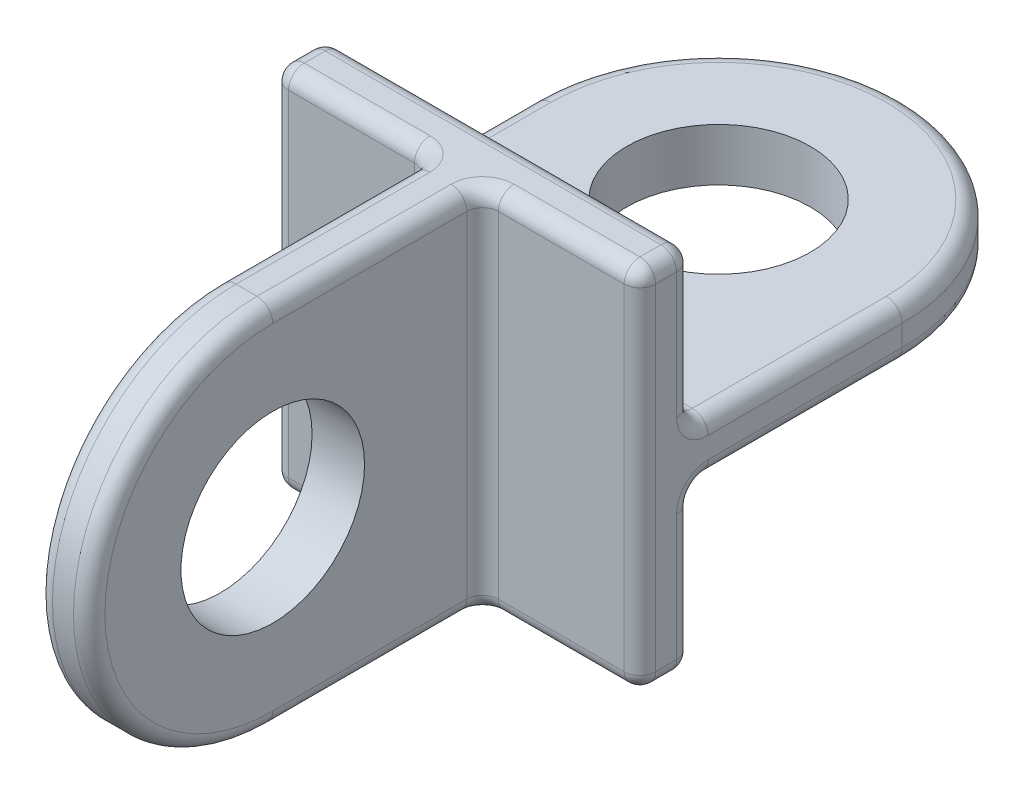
ISO-10303-21;
HEADER;
FILE_DESCRIPTION(('STEP AP214'),'2;1');
FILE_NAME('part.step','',(''),(''),'','','');
FILE_SCHEMA(('AUTOMOTIVE_DESIGN { 1 0 10303 214 1 1 1 1 }'));
ENDSEC;
DATA;
#1=APPLICATION_CONTEXT('core data for automotive mechanical design processes');
#2=APPLICATION_PROTOCOL_DEFINITION('international standard','automotive_design',2000,#1);
#3=PRODUCT_CONTEXT('',#1,'mechanical');
#4=PRODUCT('Part','Part','',(#3));
#5=PRODUCT_RELATED_PRODUCT_CATEGORY('part','',(#4));
#6=PRODUCT_DEFINITION_FORMATION('','',#4);
#7=PRODUCT_DEFINITION_CONTEXT('part definition',#1,'design');
#8=PRODUCT_DEFINITION('design','',#6,#7);
#9=PRODUCT_DEFINITION_SHAPE('','',#8);
#10=(LENGTH_UNIT() NAMED_UNIT(*) SI_UNIT(.MILLI.,.METRE.));
#11=(NAMED_UNIT(*) PLANE_ANGLE_UNIT() SI_UNIT($,.RADIAN.));
#12=(NAMED_UNIT(*) SI_UNIT($,.STERADIAN.) SOLID_ANGLE_UNIT());
#13=UNCERTAINTY_MEASURE_WITH_UNIT(LENGTH_MEASURE(1.E-05),#10,'distance_accuracy_value','');
#14=(GEOMETRIC_REPRESENTATION_CONTEXT(3) GLOBAL_UNCERTAINTY_ASSIGNED_CONTEXT((#13)) GLOBAL_UNIT_ASSIGNED_CONTEXT((#10,
#11,#12)) REPRESENTATION_CONTEXT('',''));
#15=CARTESIAN_POINT('',(0.,0.,0.));
#16=DIRECTION('',(0.,0.,1.));
#17=DIRECTION('',(1.,0.,0.));
#18=AXIS2_PLACEMENT_3D('',#15,#16,#17);
#19=CARTESIAN_POINT('',(-35.,35.,5.));
#20=DIRECTION('',(0.,0.,-1.));
#21=DIRECTION('',(-1.,0.,0.));
#22=AXIS2_PLACEMENT_3D('',#19,#20,#21);
#23=PLANE('',#22);
#24=DIRECTION('',(0.,1.,0.));
#25=VECTOR('',#24,1.);
#26=CARTESIAN_POINT('',(32.,35.,5.));
#27=LINE('',#26,#25);
#28=CARTESIAN_POINT('',(32.,-32.,5.));
#29=VERTEX_POINT('',#28);
#30=CARTESIAN_POINT('',(32.,32.,5.));
#31=VERTEX_POINT('',#30);
#32=EDGE_CURVE('E520',#29,#31,#27,.T.);
#33=ORIENTED_EDGE('',*,*,#32,.T.);
#34=DIRECTION('',(-1.,0.,0.));
#35=VECTOR('',#34,1.);
#36=CARTESIAN_POINT('',(-35.,32.,5.));
#37=LINE('',#36,#35);
#38=CARTESIAN_POINT('',(8.0000000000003,32.,5.));
#39=VERTEX_POINT('',#38);
#40=EDGE_CURVE('E523',#31,#39,#37,.T.);
#41=ORIENTED_EDGE('',*,*,#40,.T.);
#42=DIRECTION('',(0.,1.,0.));
#43=VECTOR('',#42,1.);
#44=CARTESIAN_POINT('',(8.0000000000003,35.,5.));
#45=LINE('',#44,#43);
#46=CARTESIAN_POINT('',(8.0000000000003,-32.,5.));
#47=VERTEX_POINT('',#46);
#48=EDGE_CURVE('E608',#39,#47,#45,.F.);
#49=ORIENTED_EDGE('',*,*,#48,.T.);
#50=DIRECTION('',(1.,0.,0.));
#51=VECTOR('',#50,1.);
#52=CARTESIAN_POINT('',(-35.,-32.,5.));
#53=LINE('',#52,#51);
#54=EDGE_CURVE('E518',#47,#29,#53,.T.);
#55=ORIENTED_EDGE('',*,*,#54,.T.);
#56=EDGE_LOOP('',(#33,#41,#49,#55));
#57=FACE_BOUND('',#56,.T.);
#58=ADVANCED_FACE('F36',(#57),#23,.F.);
#59=CARTESIAN_POINT('',(-35.,35.,-5.));
#60=DIRECTION('',(0.,0.,-1.));
#61=DIRECTION('',(-1.,0.,0.));
#62=AXIS2_PLACEMENT_3D('',#59,#60,#61);
#63=PLANE('',#62);
#64=DIRECTION('',(-1.,0.,0.));
#65=VECTOR('',#64,1.);
#66=CARTESIAN_POINT('',(32.,32.,-5.));
#67=LINE('',#66,#65);
#68=CARTESIAN_POINT('',(-32.,32.,-5.));
#69=VERTEX_POINT('',#68);
#70=CARTESIAN_POINT('',(32.,32.,-5.));
#71=VERTEX_POINT('',#70);
#72=EDGE_CURVE('E459',#69,#71,#67,.F.);
#73=ORIENTED_EDGE('',*,*,#72,.T.);
#74=DIRECTION('',(0.,1.,0.));
#75=VECTOR('',#74,1.);
#76=CARTESIAN_POINT('',(32.,7.99999999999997,-5.));
#77=LINE('',#76,#75);
#78=CARTESIAN_POINT('',(32.,7.99999999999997,-5.));
#79=VERTEX_POINT('',#78);
#80=EDGE_CURVE('E463',#71,#79,#77,.F.);
#81=ORIENTED_EDGE('',*,*,#80,.T.);
#82=DIRECTION('',(-1.,0.,0.));
#83=VECTOR('',#82,1.);
#84=CARTESIAN_POINT('',(-35.,7.99999999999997,-5.));
#85=LINE('',#84,#83);
#86=CARTESIAN_POINT('',(-32.,7.99999999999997,-5.));
#87=VERTEX_POINT('',#86);
#88=EDGE_CURVE('E645',#79,#87,#85,.T.);
#89=ORIENTED_EDGE('',*,*,#88,.T.);
#90=DIRECTION('',(0.,-1.,0.));
#91=VECTOR('',#90,1.);
#92=CARTESIAN_POINT('',(-32.,32.,-5.));
#93=LINE('',#92,#91);
#94=EDGE_CURVE('E461',#87,#69,#93,.F.);
#95=ORIENTED_EDGE('',*,*,#94,.T.);
#96=EDGE_LOOP('',(#73,#81,#89,#95));
#97=FACE_BOUND('',#96,.T.);
#98=ADVANCED_FACE('F837',(#97),#63,.T.);
#99=CARTESIAN_POINT('',(-35.,-35.,5.));
#100=DIRECTION('',(1.,0.,0.));
#101=DIRECTION('',(0.,0.,-1.));
#102=AXIS2_PLACEMENT_3D('',#99,#100,#101);
#103=PLANE('',#102);
#104=DIRECTION('',(0.,1.,0.));
#105=VECTOR('',#104,1.);
#106=CARTESIAN_POINT('',(-35.,-5.00000000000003,-44.9999999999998));
#107=LINE('',#106,#105);
#108=CARTESIAN_POINT('',(-35.,-2.00000000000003,-44.9999999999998));
#109=VERTEX_POINT('',#108);
#110=CARTESIAN_POINT('',(-35.,1.99999999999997,-44.9999999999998));
#111=VERTEX_POINT('',#110);
#112=EDGE_CURVE('E637',#109,#111,#107,.T.);
#113=ORIENTED_EDGE('',*,*,#112,.F.);
#114=DIRECTION('',(0.,0.,-1.));
#115=VECTOR('',#114,1.);
#116=CARTESIAN_POINT('',(-35.,-2.00000000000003,-8.));
#117=LINE('',#116,#115);
#118=CARTESIAN_POINT('',(-35.,-2.00000000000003,-8.));
#119=VERTEX_POINT('',#118);
#120=EDGE_CURVE('E551',#109,#119,#117,.F.);
#121=ORIENTED_EDGE('',*,*,#120,.T.);
#122=CARTESIAN_POINT('',(-35.,-8.00000000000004,-8.));
#123=DIRECTION('',(1.,0.,0.));
#124=DIRECTION('',(0.,0.,-1.));
#125=AXIS2_PLACEMENT_3D('',#122,#123,#124);
#126=CIRCLE('',#125,6.);
#127=CARTESIAN_POINT('',(-35.,-8.00000000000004,-2.));
#128=VERTEX_POINT('',#127);
#129=EDGE_CURVE('E549',#119,#128,#126,.T.);
#130=ORIENTED_EDGE('',*,*,#129,.T.);
#131=DIRECTION('',(0.,-1.,0.));
#132=VECTOR('',#131,1.);
#133=CARTESIAN_POINT('',(-35.,-32.,-2.));
#134=LINE('',#133,#132);
#135=CARTESIAN_POINT('',(-35.,-32.,-2.));
#136=VERTEX_POINT('',#135);
#137=EDGE_CURVE('E547',#128,#136,#134,.T.);
#138=ORIENTED_EDGE('',*,*,#137,.T.);
#139=DIRECTION('',(0.,0.,-1.));
#140=VECTOR('',#139,1.);
#141=CARTESIAN_POINT('',(-35.,-32.,5.));
#142=LINE('',#141,#140);
#143=CARTESIAN_POINT('',(-35.,-32.,2.));
#144=VERTEX_POINT('',#143);
#145=EDGE_CURVE('E639',#136,#144,#142,.F.);
#146=ORIENTED_EDGE('',*,*,#145,.T.);
#147=DIRECTION('',(0.,-1.,0.));
#148=VECTOR('',#147,1.);
#149=CARTESIAN_POINT('',(-35.,-35.,2.));
#150=LINE('',#149,#148);
#151=CARTESIAN_POINT('',(-35.,32.,2.));
#152=VERTEX_POINT('',#151);
#153=EDGE_CURVE('E545',#144,#152,#150,.F.);
#154=ORIENTED_EDGE('',*,*,#153,.T.);
#155=DIRECTION('',(0.,0.,-1.));
#156=VECTOR('',#155,1.);
#157=CARTESIAN_POINT('',(-35.,32.,5.));
#158=LINE('',#157,#156);
#159=CARTESIAN_POINT('',(-35.,32.,-2.));
#160=VERTEX_POINT('',#159);
#161=EDGE_CURVE('E642',#152,#160,#158,.T.);
#162=ORIENTED_EDGE('',*,*,#161,.T.);
#163=DIRECTION('',(0.,-1.,0.));
#164=VECTOR('',#163,1.);
#165=CARTESIAN_POINT('',(-35.,7.99999999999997,-2.));
#166=LINE('',#165,#164);
#167=CARTESIAN_POINT('',(-35.,7.99999999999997,-2.));
#168=VERTEX_POINT('',#167);
#169=EDGE_CURVE('E539',#160,#168,#166,.T.);
#170=ORIENTED_EDGE('',*,*,#169,.T.);
#171=CARTESIAN_POINT('',(-35.,7.99999999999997,-8.));
#172=DIRECTION('',(1.,0.,0.));
#173=DIRECTION('',(0.,0.,-1.));
#174=AXIS2_PLACEMENT_3D('',#171,#172,#173);
#175=CIRCLE('',#174,6.);
#176=CARTESIAN_POINT('',(-35.,1.99999999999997,-8.));
#177=VERTEX_POINT('',#176);
#178=EDGE_CURVE('E541',#168,#177,#175,.T.);
#179=ORIENTED_EDGE('',*,*,#178,.T.);
#180=DIRECTION('',(0.,0.,-1.));
#181=VECTOR('',#180,1.);
#182=CARTESIAN_POINT('',(-35.,1.99999999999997,5.));
#183=LINE('',#182,#181);
#184=EDGE_CURVE('E543',#177,#111,#183,.T.);
#185=ORIENTED_EDGE('',*,*,#184,.T.);
#186=EDGE_LOOP('',(#113,#121,#130,#138,#146,#154,#162,#170,#179,#185));
#187=FACE_BOUND('',#186,.T.);
#188=ADVANCED_FACE('F674',(#187),#103,.F.);
#189=CARTESIAN_POINT('',(-35.,-35.,5.));
#190=DIRECTION('',(0.,1.,0.));
#191=DIRECTION('',(0.,0.,1.));
#192=AXIS2_PLACEMENT_3D('',#189,#190,#191);
#193=PLANE('',#192);
#194=DIRECTION('',(-1.,0.,0.));
#195=VECTOR('',#194,1.);
#196=CARTESIAN_POINT('',(5.0000000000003,-35.,45.));
#197=LINE('',#196,#195);
#198=CARTESIAN_POINT('',(2.0000000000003,-35.,45.));
#199=VERTEX_POINT('',#198);
#200=CARTESIAN_POINT('',(-1.9999999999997,-35.,45.));
#201=VERTEX_POINT('',#200);
#202=EDGE_CURVE('E616',#199,#201,#197,.T.);
#203=ORIENTED_EDGE('',*,*,#202,.T.);
#204=DIRECTION('',(0.,0.,-1.));
#205=VECTOR('',#204,1.);
#206=CARTESIAN_POINT('',(-1.9999999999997,-35.,5.));
#207=LINE('',#206,#205);
#208=CARTESIAN_POINT('',(-1.9999999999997,-35.,8.));
#209=VERTEX_POINT('',#208);
#210=EDGE_CURVE('E504',#201,#209,#207,.T.);
#211=ORIENTED_EDGE('',*,*,#210,.T.);
#212=CARTESIAN_POINT('',(-7.9999999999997,-35.,8.));
#213=DIRECTION('',(0.,1.,0.));
#214=DIRECTION('',(0.,0.,1.));
#215=AXIS2_PLACEMENT_3D('',#212,#213,#214);
#216=CIRCLE('',#215,6.);
#217=CARTESIAN_POINT('',(-7.9999999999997,-35.,2.));
#218=VERTEX_POINT('',#217);
#219=EDGE_CURVE('E501',#209,#218,#216,.T.);
#220=ORIENTED_EDGE('',*,*,#219,.T.);
#221=DIRECTION('',(1.,0.,0.));
#222=VECTOR('',#221,1.);
#223=CARTESIAN_POINT('',(-35.,-35.,2.));
#224=LINE('',#223,#222);
#225=CARTESIAN_POINT('',(-32.,-35.,2.));
#226=VERTEX_POINT('',#225);
#227=EDGE_CURVE('E499',#218,#226,#224,.F.);
#228=ORIENTED_EDGE('',*,*,#227,.T.);
#229=DIRECTION('',(0.,0.,-1.));
#230=VECTOR('',#229,1.);
#231=CARTESIAN_POINT('',(-32.,-35.,5.));
#232=LINE('',#231,#230);
#233=CARTESIAN_POINT('',(-32.,-35.,-2.));
#234=VERTEX_POINT('',#233);
#235=EDGE_CURVE('E590',#226,#234,#232,.T.);
#236=ORIENTED_EDGE('',*,*,#235,.T.);
#237=DIRECTION('',(1.,0.,0.));
#238=VECTOR('',#237,1.);
#239=CARTESIAN_POINT('',(32.,-35.,-2.));
#240=LINE('',#239,#238);
#241=CARTESIAN_POINT('',(32.,-35.,-2.));
#242=VERTEX_POINT('',#241);
#243=EDGE_CURVE('E485',#234,#242,#240,.T.);
#244=ORIENTED_EDGE('',*,*,#243,.T.);
#245=DIRECTION('',(0.,0.,-1.));
#246=VECTOR('',#245,1.);
#247=CARTESIAN_POINT('',(32.,-35.,5.));
#248=LINE('',#247,#246);
#249=CARTESIAN_POINT('',(32.,-35.,2.));
#250=VERTEX_POINT('',#249);
#251=EDGE_CURVE('E577',#242,#250,#248,.F.);
#252=ORIENTED_EDGE('',*,*,#251,.T.);
#253=DIRECTION('',(1.,0.,0.));
#254=VECTOR('',#253,1.);
#255=CARTESIAN_POINT('',(-35.,-35.,2.));
#256=LINE('',#255,#254);
#257=CARTESIAN_POINT('',(8.0000000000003,-35.,2.));
#258=VERTEX_POINT('',#257);
#259=EDGE_CURVE('E497',#250,#258,#256,.F.);
#260=ORIENTED_EDGE('',*,*,#259,.T.);
#261=CARTESIAN_POINT('',(8.0000000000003,-35.,8.));
#262=DIRECTION('',(0.,1.,0.));
#263=DIRECTION('',(0.,0.,1.));
#264=AXIS2_PLACEMENT_3D('',#261,#262,#263);
#265=CIRCLE('',#264,6.);
#266=CARTESIAN_POINT('',(2.0000000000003,-35.,8.));
#267=VERTEX_POINT('',#266);
#268=EDGE_CURVE('E495',#258,#267,#265,.T.);
#269=ORIENTED_EDGE('',*,*,#268,.T.);
#270=DIRECTION('',(0.,0.,-1.));
#271=VECTOR('',#270,1.);
#272=CARTESIAN_POINT('',(2.0000000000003,-35.,45.));
#273=LINE('',#272,#271);
#274=EDGE_CURVE('E418',#267,#199,#273,.F.);
#275=ORIENTED_EDGE('',*,*,#274,.T.);
#276=EDGE_LOOP('',(#203,#211,#220,#228,#236,#244,#252,#260,#269,#275));
#277=FACE_BOUND('',#276,.T.);
#278=ADVANCED_FACE('F586',(#277),#193,.F.);
#279=CARTESIAN_POINT('',(35.,-35.,5.));
#280=DIRECTION('',(-1.,0.,0.));
#281=DIRECTION('',(0.,0.,1.));
#282=AXIS2_PLACEMENT_3D('',#279,#280,#281);
#283=PLANE('',#282);
#284=DIRECTION('',(0.,0.,-1.));
#285=VECTOR('',#284,1.);
#286=CARTESIAN_POINT('',(35.,32.,5.));
#287=LINE('',#286,#285);
#288=CARTESIAN_POINT('',(35.,32.,-2.));
#289=VERTEX_POINT('',#288);
#290=CARTESIAN_POINT('',(35.,32.,2.));
#291=VERTEX_POINT('',#290);
#292=EDGE_CURVE('E659',#289,#291,#287,.F.);
#293=ORIENTED_EDGE('',*,*,#292,.T.);
#294=DIRECTION('',(0.,1.,0.));
#295=VECTOR('',#294,1.);
#296=CARTESIAN_POINT('',(35.,-35.,2.));
#297=LINE('',#296,#295);
#298=CARTESIAN_POINT('',(35.,-32.,2.));
#299=VERTEX_POINT('',#298);
#300=EDGE_CURVE('E536',#291,#299,#297,.F.);
#301=ORIENTED_EDGE('',*,*,#300,.T.);
#302=DIRECTION('',(0.,0.,-1.));
#303=VECTOR('',#302,1.);
#304=CARTESIAN_POINT('',(35.,-32.,5.));
#305=LINE('',#304,#303);
#306=CARTESIAN_POINT('',(35.,-32.,-2.));
#307=VERTEX_POINT('',#306);
#308=EDGE_CURVE('E580',#299,#307,#305,.T.);
#309=ORIENTED_EDGE('',*,*,#308,.T.);
#310=DIRECTION('',(0.,1.,0.));
#311=VECTOR('',#310,1.);
#312=CARTESIAN_POINT('',(35.,-8.00000000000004,-2.));
#313=LINE('',#312,#311);
#314=CARTESIAN_POINT('',(35.,-8.00000000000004,-2.));
#315=VERTEX_POINT('',#314);
#316=EDGE_CURVE('E531',#307,#315,#313,.T.);
#317=ORIENTED_EDGE('',*,*,#316,.T.);
#318=CARTESIAN_POINT('',(35.,-8.00000000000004,-8.));
#319=DIRECTION('',(-1.,0.,0.));
#320=DIRECTION('',(0.,0.,1.));
#321=AXIS2_PLACEMENT_3D('',#318,#319,#320);
#322=CIRCLE('',#321,6.);
#323=CARTESIAN_POINT('',(35.,-2.00000000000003,-8.));
#324=VERTEX_POINT('',#323);
#325=EDGE_CURVE('E533',#315,#324,#322,.T.);
#326=ORIENTED_EDGE('',*,*,#325,.T.);
#327=DIRECTION('',(0.,0.,1.));
#328=VECTOR('',#327,1.);
#329=CARTESIAN_POINT('',(35.,-2.00000000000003,-44.9999999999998));
#330=LINE('',#329,#328);
#331=CARTESIAN_POINT('',(35.,-2.00000000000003,-44.9999999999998));
#332=VERTEX_POINT('',#331);
#333=EDGE_CURVE('E303',#324,#332,#330,.F.);
#334=ORIENTED_EDGE('',*,*,#333,.T.);
#335=DIRECTION('',(0.,1.,0.));
#336=VECTOR('',#335,1.);
#337=CARTESIAN_POINT('',(35.,-5.00000000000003,-44.9999999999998));
#338=LINE('',#337,#336);
#339=CARTESIAN_POINT('',(35.,1.99999999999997,-44.9999999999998));
#340=VERTEX_POINT('',#339);
#341=EDGE_CURVE('E632',#332,#340,#338,.T.);
#342=ORIENTED_EDGE('',*,*,#341,.T.);
#343=DIRECTION('',(0.,0.,1.));
#344=VECTOR('',#343,1.);
#345=CARTESIAN_POINT('',(35.,1.99999999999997,5.));
#346=LINE('',#345,#344);
#347=CARTESIAN_POINT('',(35.,1.99999999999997,-8.));
#348=VERTEX_POINT('',#347);
#349=EDGE_CURVE('E529',#340,#348,#346,.T.);
#350=ORIENTED_EDGE('',*,*,#349,.T.);
#351=CARTESIAN_POINT('',(35.,7.99999999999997,-8.));
#352=DIRECTION('',(-1.,0.,0.));
#353=DIRECTION('',(0.,0.,1.));
#354=AXIS2_PLACEMENT_3D('',#351,#352,#353);
#355=CIRCLE('',#354,6.);
#356=CARTESIAN_POINT('',(35.,7.99999999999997,-2.));
#357=VERTEX_POINT('',#356);
#358=EDGE_CURVE('E527',#348,#357,#355,.T.);
#359=ORIENTED_EDGE('',*,*,#358,.T.);
#360=DIRECTION('',(0.,1.,0.));
#361=VECTOR('',#360,1.);
#362=CARTESIAN_POINT('',(35.,32.,-2.));
#363=LINE('',#362,#361);
#364=EDGE_CURVE('E525',#357,#289,#363,.T.);
#365=ORIENTED_EDGE('',*,*,#364,.T.);
#366=EDGE_LOOP('',(#293,#301,#309,#317,#326,#334,#342,#350,#359,#365));
#367=FACE_BOUND('',#366,.T.);
#368=ADVANCED_FACE('F702',(#367),#283,.F.);
#369=CARTESIAN_POINT('',(-35.,35.,5.));
#370=DIRECTION('',(0.,-1.,0.));
#371=DIRECTION('',(0.,0.,-1.));
#372=AXIS2_PLACEMENT_3D('',#369,#370,#371);
#373=PLANE('',#372);
#374=CARTESIAN_POINT('',(8.0000000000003,35.,8.));
#375=DIRECTION('',(0.,-1.,0.));
#376=DIRECTION('',(0.,0.,-1.));
#377=AXIS2_PLACEMENT_3D('',#374,#375,#376);
#378=CIRCLE('',#377,6.);
#379=CARTESIAN_POINT('',(2.0000000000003,35.,8.));
#380=VERTEX_POINT('',#379);
#381=CARTESIAN_POINT('',(8.0000000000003,35.,2.));
#382=VERTEX_POINT('',#381);
#383=EDGE_CURVE('E449',#380,#382,#378,.T.);
#384=ORIENTED_EDGE('',*,*,#383,.T.);
#385=DIRECTION('',(-1.,0.,0.));
#386=VECTOR('',#385,1.);
#387=CARTESIAN_POINT('',(-35.,35.,2.));
#388=LINE('',#387,#386);
#389=CARTESIAN_POINT('',(32.,35.,2.));
#390=VERTEX_POINT('',#389);
#391=EDGE_CURVE('E451',#382,#390,#388,.F.);
#392=ORIENTED_EDGE('',*,*,#391,.T.);
#393=DIRECTION('',(0.,0.,-1.));
#394=VECTOR('',#393,1.);
#395=CARTESIAN_POINT('',(32.,35.,5.));
#396=LINE('',#395,#394);
#397=CARTESIAN_POINT('',(32.,35.,-2.));
#398=VERTEX_POINT('',#397);
#399=EDGE_CURVE('E648',#390,#398,#396,.T.);
#400=ORIENTED_EDGE('',*,*,#399,.T.);
#401=DIRECTION('',(-1.,0.,0.));
#402=VECTOR('',#401,1.);
#403=CARTESIAN_POINT('',(-32.,35.,-2.));
#404=LINE('',#403,#402);
#405=CARTESIAN_POINT('',(-32.,35.,-2.));
#406=VERTEX_POINT('',#405);
#407=EDGE_CURVE('E439',#398,#406,#404,.T.);
#408=ORIENTED_EDGE('',*,*,#407,.T.);
#409=DIRECTION('',(0.,0.,-1.));
#410=VECTOR('',#409,1.);
#411=CARTESIAN_POINT('',(-32.,35.,5.));
#412=LINE('',#411,#410);
#413=CARTESIAN_POINT('',(-32.,35.,2.));
#414=VERTEX_POINT('',#413);
#415=EDGE_CURVE('E651',#406,#414,#412,.F.);
#416=ORIENTED_EDGE('',*,*,#415,.T.);
#417=DIRECTION('',(-1.,0.,0.));
#418=VECTOR('',#417,1.);
#419=CARTESIAN_POINT('',(-35.,35.,2.));
#420=LINE('',#419,#418);
#421=CARTESIAN_POINT('',(-7.9999999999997,35.,2.));
#422=VERTEX_POINT('',#421);
#423=EDGE_CURVE('E441',#414,#422,#420,.F.);
#424=ORIENTED_EDGE('',*,*,#423,.T.);
#425=CARTESIAN_POINT('',(-7.9999999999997,35.,8.));
#426=DIRECTION('',(0.,-1.,0.));
#427=DIRECTION('',(0.,0.,-1.));
#428=AXIS2_PLACEMENT_3D('',#425,#426,#427);
#429=CIRCLE('',#428,6.);
#430=CARTESIAN_POINT('',(-1.9999999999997,35.,8.));
#431=VERTEX_POINT('',#430);
#432=EDGE_CURVE('E443',#422,#431,#429,.T.);
#433=ORIENTED_EDGE('',*,*,#432,.T.);
#434=DIRECTION('',(0.,0.,1.));
#435=VECTOR('',#434,1.);
#436=CARTESIAN_POINT('',(-1.9999999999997,35.,5.));
#437=LINE('',#436,#435);
#438=CARTESIAN_POINT('',(-1.9999999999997,35.,45.));
#439=VERTEX_POINT('',#438);
#440=EDGE_CURVE('E445',#431,#439,#437,.T.);
#441=ORIENTED_EDGE('',*,*,#440,.T.);
#442=DIRECTION('',(-1.,0.,0.));
#443=VECTOR('',#442,1.);
#444=CARTESIAN_POINT('',(5.0000000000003,35.,45.));
#445=LINE('',#444,#443);
#446=CARTESIAN_POINT('',(2.0000000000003,35.,45.));
#447=VERTEX_POINT('',#446);
#448=EDGE_CURVE('E620',#447,#439,#445,.T.);
#449=ORIENTED_EDGE('',*,*,#448,.F.);
#450=DIRECTION('',(0.,0.,1.));
#451=VECTOR('',#450,1.);
#452=CARTESIAN_POINT('',(2.0000000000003,35.,8.));
#453=LINE('',#452,#451);
#454=EDGE_CURVE('E447',#447,#380,#453,.F.);
#455=ORIENTED_EDGE('',*,*,#454,.T.);
#456=EDGE_LOOP('',(#384,#392,#400,#408,#416,#424,#433,#441,#449,#455));
#457=FACE_BOUND('',#456,.T.);
#458=ADVANCED_FACE('F722',(#457),#373,.F.);
#459=DIRECTION('',(0.,-1.,0.));
#460=VECTOR('',#459,1.);
#461=CARTESIAN_POINT('',(-32.,35.,5.));
#462=LINE('',#461,#460);
#463=CARTESIAN_POINT('',(-32.,32.,5.));
#464=VERTEX_POINT('',#463);
#465=CARTESIAN_POINT('',(-32.,-32.,5.));
#466=VERTEX_POINT('',#465);
#467=EDGE_CURVE('E561',#464,#466,#462,.T.);
#468=ORIENTED_EDGE('',*,*,#467,.T.);
#469=DIRECTION('',(1.,0.,0.));
#470=VECTOR('',#469,1.);
#471=CARTESIAN_POINT('',(-35.,-32.,5.));
#472=LINE('',#471,#470);
#473=CARTESIAN_POINT('',(-7.9999999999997,-32.,5.));
#474=VERTEX_POINT('',#473);
#475=EDGE_CURVE('E563',#466,#474,#472,.T.);
#476=ORIENTED_EDGE('',*,*,#475,.T.);
#477=DIRECTION('',(0.,1.,0.));
#478=VECTOR('',#477,1.);
#479=CARTESIAN_POINT('',(-7.9999999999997,35.,5.));
#480=LINE('',#479,#478);
#481=CARTESIAN_POINT('',(-7.9999999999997,32.,5.));
#482=VERTEX_POINT('',#481);
#483=EDGE_CURVE('E591',#474,#482,#480,.T.);
#484=ORIENTED_EDGE('',*,*,#483,.T.);
#485=DIRECTION('',(-1.,0.,0.));
#486=VECTOR('',#485,1.);
#487=CARTESIAN_POINT('',(-35.,32.,5.));
#488=LINE('',#487,#486);
#489=EDGE_CURVE('E559',#482,#464,#488,.T.);
#490=ORIENTED_EDGE('',*,*,#489,.T.);
#491=EDGE_LOOP('',(#468,#476,#484,#490));
#492=FACE_BOUND('',#491,.T.);
#493=ADVANCED_FACE('F839',(#492),#23,.F.);
#494=DIRECTION('',(1.,0.,0.));
#495=VECTOR('',#494,1.);
#496=CARTESIAN_POINT('',(-32.,-32.,-5.));
#497=LINE('',#496,#495);
#498=CARTESIAN_POINT('',(32.,-32.,-5.));
#499=VERTEX_POINT('',#498);
#500=CARTESIAN_POINT('',(-32.,-32.,-5.));
#501=VERTEX_POINT('',#500);
#502=EDGE_CURVE('E453',#499,#501,#497,.F.);
#503=ORIENTED_EDGE('',*,*,#502,.T.);
#504=DIRECTION('',(0.,-1.,0.));
#505=VECTOR('',#504,1.);
#506=CARTESIAN_POINT('',(-32.,-8.00000000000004,-5.));
#507=LINE('',#506,#505);
#508=CARTESIAN_POINT('',(-32.,-8.00000000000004,-5.));
#509=VERTEX_POINT('',#508);
#510=EDGE_CURVE('E457',#501,#509,#507,.F.);
#511=ORIENTED_EDGE('',*,*,#510,.T.);
#512=DIRECTION('',(-1.,0.,0.));
#513=VECTOR('',#512,1.);
#514=CARTESIAN_POINT('',(35.,-8.00000000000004,-5.));
#515=LINE('',#514,#513);
#516=CARTESIAN_POINT('',(32.,-8.00000000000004,-5.));
#517=VERTEX_POINT('',#516);
#518=EDGE_CURVE('E657',#509,#517,#515,.F.);
#519=ORIENTED_EDGE('',*,*,#518,.T.);
#520=DIRECTION('',(0.,1.,0.));
#521=VECTOR('',#520,1.);
#522=CARTESIAN_POINT('',(32.,-32.,-5.));
#523=LINE('',#522,#521);
#524=EDGE_CURVE('E455',#517,#499,#523,.F.);
#525=ORIENTED_EDGE('',*,*,#524,.T.);
#526=EDGE_LOOP('',(#503,#511,#519,#525));
#527=FACE_BOUND('',#526,.T.);
#528=ADVANCED_FACE('F844',(#527),#63,.T.);
#529=CARTESIAN_POINT('',(0.,-5.00000000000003,-44.9999999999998));
#530=DIRECTION('',(0.,-1.,0.));
#531=DIRECTION('',(0.,0.,-1.));
#532=AXIS2_PLACEMENT_3D('',#529,#530,#531);
#533=PLANE('',#532);
#534=DIRECTION('',(-1.,0.,0.));
#535=VECTOR('',#534,1.);
#536=CARTESIAN_POINT('',(-35.,-5.00000000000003,-8.));
#537=LINE('',#536,#535);
#538=CARTESIAN_POINT('',(32.,-5.00000000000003,-8.));
#539=VERTEX_POINT('',#538);
#540=CARTESIAN_POINT('',(-32.,-5.00000000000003,-8.));
#541=VERTEX_POINT('',#540);
#542=EDGE_CURVE('E273',#539,#541,#537,.T.);
#543=ORIENTED_EDGE('',*,*,#542,.T.);
#544=DIRECTION('',(0.,0.,-1.));
#545=VECTOR('',#544,1.);
#546=CARTESIAN_POINT('',(-32.,-5.00000000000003,-44.9999999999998));
#547=LINE('',#546,#545);
#548=CARTESIAN_POINT('',(-32.,-5.00000000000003,-44.9999999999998));
#549=VERTEX_POINT('',#548);
#550=EDGE_CURVE('E490',#541,#549,#547,.T.);
#551=ORIENTED_EDGE('',*,*,#550,.T.);
#552=CARTESIAN_POINT('',(0.,-5.00000000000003,-44.9999999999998));
#553=DIRECTION('',(0.,-1.,0.));
#554=DIRECTION('',(0.,0.,-1.));
#555=AXIS2_PLACEMENT_3D('',#552,#553,#554);
#556=CIRCLE('',#555,32.);
#557=CARTESIAN_POINT('',(32.,-5.00000000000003,-44.9999999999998));
#558=VERTEX_POINT('',#557);
#559=EDGE_CURVE('E276',#549,#558,#556,.T.);
#560=ORIENTED_EDGE('',*,*,#559,.T.);
#561=DIRECTION('',(0.,0.,1.));
#562=VECTOR('',#561,1.);
#563=CARTESIAN_POINT('',(32.,-5.00000000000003,-8.));
#564=LINE('',#563,#562);
#565=EDGE_CURVE('E269',#558,#539,#564,.T.);
#566=ORIENTED_EDGE('',*,*,#565,.T.);
#567=EDGE_LOOP('',(#543,#551,#560,#566));
#568=FACE_BOUND('',#567,.T.);
#569=CARTESIAN_POINT('',(0.,-5.00000000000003,-44.9999999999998));
#570=DIRECTION('',(0.,-1.,0.));
#571=DIRECTION('',(0.,0.,-1.));
#572=AXIS2_PLACEMENT_3D('',#569,#570,#571);
#573=CIRCLE('',#572,17.5);
#574=CARTESIAN_POINT('',(0.,-5.00000000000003,-62.4999999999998));
#575=VERTEX_POINT('',#574);
#576=EDGE_CURVE('E629',#575,#575,#573,.T.);
#577=ORIENTED_EDGE('',*,*,#576,.F.);
#578=EDGE_LOOP('',(#577));
#579=FACE_BOUND('',#578,.T.);
#580=ADVANCED_FACE('F271',(#568,#579),#533,.T.);
#581=CARTESIAN_POINT('',(0.,4.99999999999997,-44.9999999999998));
#582=DIRECTION('',(0.,-1.,0.));
#583=DIRECTION('',(0.,0.,-1.));
#584=AXIS2_PLACEMENT_3D('',#581,#582,#583);
#585=PLANE('',#584);
#586=DIRECTION('',(-1.,0.,0.));
#587=VECTOR('',#586,1.);
#588=CARTESIAN_POINT('',(0.,4.99999999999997,-8.));
#589=LINE('',#588,#587);
#590=CARTESIAN_POINT('',(-32.,4.99999999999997,-8.));
#591=VERTEX_POINT('',#590);
#592=CARTESIAN_POINT('',(32.,4.99999999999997,-8.));
#593=VERTEX_POINT('',#592);
#594=EDGE_CURVE('E289',#591,#593,#589,.F.);
#595=ORIENTED_EDGE('',*,*,#594,.T.);
#596=DIRECTION('',(0.,0.,1.));
#597=VECTOR('',#596,1.);
#598=CARTESIAN_POINT('',(32.,4.99999999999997,-44.9999999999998));
#599=LINE('',#598,#597);
#600=CARTESIAN_POINT('',(32.,4.99999999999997,-44.9999999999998));
#601=VERTEX_POINT('',#600);
#602=EDGE_CURVE('E516',#593,#601,#599,.F.);
#603=ORIENTED_EDGE('',*,*,#602,.T.);
#604=CARTESIAN_POINT('',(0.,4.99999999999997,-44.9999999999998));
#605=DIRECTION('',(0.,-1.,0.));
#606=DIRECTION('',(0.,0.,-1.));
#607=AXIS2_PLACEMENT_3D('',#604,#605,#606);
#608=CIRCLE('',#607,32.);
#609=CARTESIAN_POINT('',(-32.,4.99999999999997,-44.9999999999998));
#610=VERTEX_POINT('',#609);
#611=EDGE_CURVE('E513',#601,#610,#608,.F.);
#612=ORIENTED_EDGE('',*,*,#611,.T.);
#613=DIRECTION('',(0.,0.,-1.));
#614=VECTOR('',#613,1.);
#615=CARTESIAN_POINT('',(-32.,4.99999999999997,-44.9999999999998));
#616=LINE('',#615,#614);
#617=EDGE_CURVE('E511',#610,#591,#616,.F.);
#618=ORIENTED_EDGE('',*,*,#617,.T.);
#619=EDGE_LOOP('',(#595,#603,#612,#618));
#620=FACE_BOUND('',#619,.T.);
#621=CARTESIAN_POINT('',(0.,4.99999999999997,-44.9999999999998));
#622=DIRECTION('',(0.,-1.,0.));
#623=DIRECTION('',(0.,0.,-1.));
#624=AXIS2_PLACEMENT_3D('',#621,#622,#623);
#625=CIRCLE('',#624,17.5);
#626=CARTESIAN_POINT('',(0.,4.99999999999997,-62.4999999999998));
#627=VERTEX_POINT('',#626);
#628=EDGE_CURVE('E623',#627,#627,#625,.T.);
#629=ORIENTED_EDGE('',*,*,#628,.T.);
#630=EDGE_LOOP('',(#629));
#631=FACE_BOUND('',#630,.T.);
#632=ADVANCED_FACE('F811',(#620,#631),#585,.F.);
#633=CARTESIAN_POINT('',(0.,-5.00000000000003,-44.9999999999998));
#634=DIRECTION('',(0.,1.,0.));
#635=DIRECTION('',(0.,0.,1.));
#636=AXIS2_PLACEMENT_3D('',#633,#634,#635);
#637=CYLINDRICAL_SURFACE('',#636,35.);
#638=ORIENTED_EDGE('',*,*,#341,.F.);
#639=CARTESIAN_POINT('',(0.,-2.00000000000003,-44.9999999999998));
#640=DIRECTION('',(0.,-1.,0.));
#641=DIRECTION('',(0.,0.,-1.));
#642=AXIS2_PLACEMENT_3D('',#639,#640,#641);
#643=CIRCLE('',#642,35.);
#644=EDGE_CURVE('E478',#332,#109,#643,.F.);
#645=ORIENTED_EDGE('',*,*,#644,.T.);
#646=ORIENTED_EDGE('',*,*,#112,.T.);
#647=CARTESIAN_POINT('',(0.,1.99999999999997,-44.9999999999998));
#648=DIRECTION('',(0.,-1.,0.));
#649=DIRECTION('',(0.,0.,-1.));
#650=AXIS2_PLACEMENT_3D('',#647,#648,#649);
#651=CIRCLE('',#650,35.);
#652=EDGE_CURVE('E486',#111,#340,#651,.T.);
#653=ORIENTED_EDGE('',*,*,#652,.T.);
#654=EDGE_LOOP('',(#638,#645,#646,#653));
#655=FACE_BOUND('',#654,.T.);
#656=ADVANCED_FACE('F799',(#655),#637,.T.);
#657=CARTESIAN_POINT('',(0.,-5.00000000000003,-44.9999999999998));
#658=DIRECTION('',(0.,1.,0.));
#659=DIRECTION('',(0.,0.,1.));
#660=AXIS2_PLACEMENT_3D('',#657,#658,#659);
#661=CYLINDRICAL_SURFACE('',#660,17.5);
#662=ORIENTED_EDGE('',*,*,#576,.T.);
#663=EDGE_LOOP('',(#662));
#664=FACE_BOUND('',#663,.T.);
#665=ORIENTED_EDGE('',*,*,#628,.F.);
#666=EDGE_LOOP('',(#665));
#667=FACE_BOUND('',#666,.T.);
#668=ADVANCED_FACE('F1276',(#664,#667),#661,.F.);
#669=CARTESIAN_POINT('',(5.0000000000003,0.,45.));
#670=DIRECTION('',(1.,0.,0.));
#671=DIRECTION('',(0.,0.,-1.));
#672=AXIS2_PLACEMENT_3D('',#669,#670,#671);
#673=PLANE('',#672);
#674=DIRECTION('',(0.,1.,0.));
#675=VECTOR('',#674,1.);
#676=CARTESIAN_POINT('',(5.0000000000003,0.,8.));
#677=LINE('',#676,#675);
#678=CARTESIAN_POINT('',(5.0000000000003,-32.,8.));
#679=VERTEX_POINT('',#678);
#680=CARTESIAN_POINT('',(5.0000000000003,32.,8.));
#681=VERTEX_POINT('',#680);
#682=EDGE_CURVE('E611',#679,#681,#677,.T.);
#683=ORIENTED_EDGE('',*,*,#682,.T.);
#684=DIRECTION('',(0.,0.,1.));
#685=VECTOR('',#684,1.);
#686=CARTESIAN_POINT('',(5.0000000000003,32.,45.));
#687=LINE('',#686,#685);
#688=CARTESIAN_POINT('',(5.0000000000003,32.,45.));
#689=VERTEX_POINT('',#688);
#690=EDGE_CURVE('E11',#681,#689,#687,.T.);
#691=ORIENTED_EDGE('',*,*,#690,.T.);
#692=CARTESIAN_POINT('',(5.0000000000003,0.,45.));
#693=DIRECTION('',(1.,0.,0.));
#694=DIRECTION('',(0.,0.,-1.));
#695=AXIS2_PLACEMENT_3D('',#692,#693,#694);
#696=CIRCLE('',#695,32.);
#697=CARTESIAN_POINT('',(5.0000000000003,-32.,45.));
#698=VERTEX_POINT('',#697);
#699=EDGE_CURVE('E52',#689,#698,#696,.T.);
#700=ORIENTED_EDGE('',*,*,#699,.T.);
#701=DIRECTION('',(0.,0.,-1.));
#702=VECTOR('',#701,1.);
#703=CARTESIAN_POINT('',(5.0000000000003,-32.,8.));
#704=LINE('',#703,#702);
#705=EDGE_CURVE('E45',#698,#679,#704,.T.);
#706=ORIENTED_EDGE('',*,*,#705,.T.);
#707=EDGE_LOOP('',(#683,#691,#700,#706));
#708=FACE_BOUND('',#707,.T.);
#709=CARTESIAN_POINT('',(5.0000000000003,0.,45.));
#710=DIRECTION('',(1.,0.,0.));
#711=DIRECTION('',(0.,0.,-1.));
#712=AXIS2_PLACEMENT_3D('',#709,#710,#711);
#713=CIRCLE('',#712,17.5);
#714=CARTESIAN_POINT('',(5.0000000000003,0.,27.5));
#715=VERTEX_POINT('',#714);
#716=EDGE_CURVE('E621',#715,#715,#713,.T.);
#717=ORIENTED_EDGE('',*,*,#716,.F.);
#718=EDGE_LOOP('',(#717));
#719=FACE_BOUND('',#718,.T.);
#720=ADVANCED_FACE('F718',(#708,#719),#673,.T.);
#721=CARTESIAN_POINT('',(-4.9999999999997,0.,45.));
#722=DIRECTION('',(1.,0.,0.));
#723=DIRECTION('',(0.,0.,-1.));
#724=AXIS2_PLACEMENT_3D('',#721,#722,#723);
#725=PLANE('',#724);
#726=DIRECTION('',(0.,1.,0.));
#727=VECTOR('',#726,1.);
#728=CARTESIAN_POINT('',(-4.9999999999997,-35.,8.));
#729=LINE('',#728,#727);
#730=CARTESIAN_POINT('',(-4.9999999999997,32.,8.));
#731=VERTEX_POINT('',#730);
#732=CARTESIAN_POINT('',(-4.9999999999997,-32.,8.));
#733=VERTEX_POINT('',#732);
#734=EDGE_CURVE('E664',#731,#733,#729,.F.);
#735=ORIENTED_EDGE('',*,*,#734,.T.);
#736=DIRECTION('',(0.,0.,-1.));
#737=VECTOR('',#736,1.);
#738=CARTESIAN_POINT('',(-4.9999999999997,-32.,45.));
#739=LINE('',#738,#737);
#740=CARTESIAN_POINT('',(-4.9999999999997,-32.,45.));
#741=VERTEX_POINT('',#740);
#742=EDGE_CURVE('E557',#733,#741,#739,.F.);
#743=ORIENTED_EDGE('',*,*,#742,.T.);
#744=CARTESIAN_POINT('',(-4.9999999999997,0.,45.));
#745=DIRECTION('',(1.,0.,0.));
#746=DIRECTION('',(0.,0.,-1.));
#747=AXIS2_PLACEMENT_3D('',#744,#745,#746);
#748=CIRCLE('',#747,32.);
#749=CARTESIAN_POINT('',(-4.9999999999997,32.,45.));
#750=VERTEX_POINT('',#749);
#751=EDGE_CURVE('E555',#741,#750,#748,.F.);
#752=ORIENTED_EDGE('',*,*,#751,.T.);
#753=DIRECTION('',(0.,0.,1.));
#754=VECTOR('',#753,1.);
#755=CARTESIAN_POINT('',(-4.9999999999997,32.,45.));
#756=LINE('',#755,#754);
#757=EDGE_CURVE('E553',#750,#731,#756,.F.);
#758=ORIENTED_EDGE('',*,*,#757,.T.);
#759=EDGE_LOOP('',(#735,#743,#752,#758));
#760=FACE_BOUND('',#759,.T.);
#761=CARTESIAN_POINT('',(-4.9999999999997,0.,45.));
#762=DIRECTION('',(1.,0.,0.));
#763=DIRECTION('',(0.,0.,-1.));
#764=AXIS2_PLACEMENT_3D('',#761,#762,#763);
#765=CIRCLE('',#764,17.5);
#766=CARTESIAN_POINT('',(-4.9999999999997,0.,27.5));
#767=VERTEX_POINT('',#766);
#768=EDGE_CURVE('E329',#767,#767,#765,.T.);
#769=ORIENTED_EDGE('',*,*,#768,.T.);
#770=EDGE_LOOP('',(#769));
#771=FACE_BOUND('',#770,.T.);
#772=ADVANCED_FACE('F1260',(#760,#771),#725,.F.);
#773=CARTESIAN_POINT('',(5.0000000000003,0.,45.));
#774=DIRECTION('',(-1.,0.,0.));
#775=DIRECTION('',(0.,0.,1.));
#776=AXIS2_PLACEMENT_3D('',#773,#774,#775);
#777=CYLINDRICAL_SURFACE('',#776,35.);
#778=ORIENTED_EDGE('',*,*,#448,.T.);
#779=CARTESIAN_POINT('',(-1.9999999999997,0.,45.));
#780=DIRECTION('',(1.,0.,0.));
#781=DIRECTION('',(0.,0.,-1.));
#782=AXIS2_PLACEMENT_3D('',#779,#780,#781);
#783=CIRCLE('',#782,35.);
#784=EDGE_CURVE('E426',#439,#201,#783,.T.);
#785=ORIENTED_EDGE('',*,*,#784,.T.);
#786=ORIENTED_EDGE('',*,*,#202,.F.);
#787=CARTESIAN_POINT('',(2.0000000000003,0.,45.));
#788=DIRECTION('',(1.,0.,0.));
#789=DIRECTION('',(0.,0.,-1.));
#790=AXIS2_PLACEMENT_3D('',#787,#788,#789);
#791=CIRCLE('',#790,35.);
#792=EDGE_CURVE('E421',#199,#447,#791,.F.);
#793=ORIENTED_EDGE('',*,*,#792,.T.);
#794=EDGE_LOOP('',(#778,#785,#786,#793));
#795=FACE_BOUND('',#794,.T.);
#796=ADVANCED_FACE('F618',(#795),#777,.T.);
#797=CARTESIAN_POINT('',(5.0000000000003,0.,45.));
#798=DIRECTION('',(-1.,0.,0.));
#799=DIRECTION('',(0.,0.,1.));
#800=AXIS2_PLACEMENT_3D('',#797,#798,#799);
#801=CYLINDRICAL_SURFACE('',#800,17.5);
#802=ORIENTED_EDGE('',*,*,#716,.T.);
#803=EDGE_LOOP('',(#802));
#804=FACE_BOUND('',#803,.T.);
#805=ORIENTED_EDGE('',*,*,#768,.F.);
#806=EDGE_LOOP('',(#805));
#807=FACE_BOUND('',#806,.T.);
#808=ADVANCED_FACE('F1243',(#804,#807),#801,.F.);
#809=CARTESIAN_POINT('',(-32.,32.,5.));
#810=DIRECTION('',(0.,0.,-1.));
#811=DIRECTION('',(-1.,0.,0.));
#812=AXIS2_PLACEMENT_3D('',#809,#810,#811);
#813=CYLINDRICAL_SURFACE('',#812,3.);
#814=ORIENTED_EDGE('',*,*,#161,.F.);
#815=CARTESIAN_POINT('',(-32.,32.,2.));
#816=DIRECTION('',(0.,0.,-1.));
#817=DIRECTION('',(-1.,0.,0.));
#818=AXIS2_PLACEMENT_3D('',#815,#816,#817);
#819=CIRCLE('',#818,3.);
#820=EDGE_CURVE('E471',#152,#414,#819,.T.);
#821=ORIENTED_EDGE('',*,*,#820,.T.);
#822=ORIENTED_EDGE('',*,*,#415,.F.);
#823=CARTESIAN_POINT('',(-32.,32.,-2.));
#824=DIRECTION('',(0.,0.,-1.));
#825=DIRECTION('',(-1.,0.,0.));
#826=AXIS2_PLACEMENT_3D('',#823,#824,#825);
#827=CIRCLE('',#826,3.);
#828=EDGE_CURVE('E469',#406,#160,#827,.F.);
#829=ORIENTED_EDGE('',*,*,#828,.T.);
#830=EDGE_LOOP('',(#814,#821,#822,#829));
#831=FACE_BOUND('',#830,.T.);
#832=ADVANCED_FACE('F757',(#831),#813,.T.);
#833=CARTESIAN_POINT('',(-32.,-32.,5.));
#834=DIRECTION('',(0.,0.,-1.));
#835=DIRECTION('',(-1.,0.,0.));
#836=AXIS2_PLACEMENT_3D('',#833,#834,#835);
#837=CYLINDRICAL_SURFACE('',#836,3.);
#838=ORIENTED_EDGE('',*,*,#235,.F.);
#839=CARTESIAN_POINT('',(-32.,-32.,2.));
#840=DIRECTION('',(0.,0.,-1.));
#841=DIRECTION('',(-1.,0.,0.));
#842=AXIS2_PLACEMENT_3D('',#839,#840,#841);
#843=CIRCLE('',#842,3.);
#844=EDGE_CURVE('E433',#226,#144,#843,.T.);
#845=ORIENTED_EDGE('',*,*,#844,.T.);
#846=ORIENTED_EDGE('',*,*,#145,.F.);
#847=CARTESIAN_POINT('',(-32.,-32.,-2.));
#848=DIRECTION('',(0.,0.,-1.));
#849=DIRECTION('',(-1.,0.,0.));
#850=AXIS2_PLACEMENT_3D('',#847,#848,#849);
#851=CIRCLE('',#850,3.);
#852=EDGE_CURVE('E428',#136,#234,#851,.F.);
#853=ORIENTED_EDGE('',*,*,#852,.T.);
#854=EDGE_LOOP('',(#838,#845,#846,#853));
#855=FACE_BOUND('',#854,.T.);
#856=ADVANCED_FACE('F688',(#855),#837,.T.);
#857=CARTESIAN_POINT('',(32.,-32.,5.));
#858=DIRECTION('',(0.,0.,-1.));
#859=DIRECTION('',(-1.,0.,0.));
#860=AXIS2_PLACEMENT_3D('',#857,#858,#859);
#861=CYLINDRICAL_SURFACE('',#860,3.);
#862=ORIENTED_EDGE('',*,*,#308,.F.);
#863=CARTESIAN_POINT('',(32.,-32.,2.));
#864=DIRECTION('',(0.,0.,-1.));
#865=DIRECTION('',(-1.,0.,0.));
#866=AXIS2_PLACEMENT_3D('',#863,#864,#865);
#867=CIRCLE('',#866,3.);
#868=EDGE_CURVE('E300',#299,#250,#867,.T.);
#869=ORIENTED_EDGE('',*,*,#868,.T.);
#870=ORIENTED_EDGE('',*,*,#251,.F.);
#871=CARTESIAN_POINT('',(32.,-32.,-2.));
#872=DIRECTION('',(0.,0.,-1.));
#873=DIRECTION('',(-1.,0.,0.));
#874=AXIS2_PLACEMENT_3D('',#871,#872,#873);
#875=CIRCLE('',#874,3.);
#876=EDGE_CURVE('E569',#242,#307,#875,.F.);
#877=ORIENTED_EDGE('',*,*,#876,.T.);
#878=EDGE_LOOP('',(#862,#869,#870,#877));
#879=FACE_BOUND('',#878,.T.);
#880=ADVANCED_FACE('F576',(#879),#861,.T.);
#881=CARTESIAN_POINT('',(32.,32.,5.));
#882=DIRECTION('',(0.,0.,-1.));
#883=DIRECTION('',(-1.,0.,0.));
#884=AXIS2_PLACEMENT_3D('',#881,#882,#883);
#885=CYLINDRICAL_SURFACE('',#884,3.);
#886=ORIENTED_EDGE('',*,*,#399,.F.);
#887=CARTESIAN_POINT('',(32.,32.,2.));
#888=DIRECTION('',(0.,0.,-1.));
#889=DIRECTION('',(-1.,0.,0.));
#890=AXIS2_PLACEMENT_3D('',#887,#888,#889);
#891=CIRCLE('',#890,3.);
#892=EDGE_CURVE('E567',#390,#291,#891,.T.);
#893=ORIENTED_EDGE('',*,*,#892,.T.);
#894=ORIENTED_EDGE('',*,*,#292,.F.);
#895=CARTESIAN_POINT('',(32.,32.,-2.));
#896=DIRECTION('',(0.,0.,-1.));
#897=DIRECTION('',(-1.,0.,0.));
#898=AXIS2_PLACEMENT_3D('',#895,#896,#897);
#899=CIRCLE('',#898,3.);
#900=EDGE_CURVE('E565',#289,#398,#899,.F.);
#901=ORIENTED_EDGE('',*,*,#900,.T.);
#902=EDGE_LOOP('',(#886,#893,#894,#901));
#903=FACE_BOUND('',#902,.T.);
#904=ADVANCED_FACE('F825',(#903),#885,.T.);
#905=CARTESIAN_POINT('',(8.0000000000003,0.,8.));
#906=DIRECTION('',(0.,1.,0.));
#907=DIRECTION('',(0.,0.,1.));
#908=AXIS2_PLACEMENT_3D('',#905,#906,#907);
#909=CYLINDRICAL_SURFACE('',#908,3.);
#910=ORIENTED_EDGE('',*,*,#48,.F.);
#911=CARTESIAN_POINT('',(8.0000000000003,32.,8.));
#912=DIRECTION('',(0.,-1.,0.));
#913=DIRECTION('',(0.,0.,-1.));
#914=AXIS2_PLACEMENT_3D('',#911,#912,#913);
#915=CIRCLE('',#914,3.);
#916=EDGE_CURVE('E467',#39,#681,#915,.F.);
#917=ORIENTED_EDGE('',*,*,#916,.T.);
#918=ORIENTED_EDGE('',*,*,#682,.F.);
#919=CARTESIAN_POINT('',(8.0000000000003,-32.,8.));
#920=DIRECTION('',(0.,1.,0.));
#921=DIRECTION('',(0.,0.,1.));
#922=AXIS2_PLACEMENT_3D('',#919,#920,#921);
#923=CIRCLE('',#922,3.);
#924=EDGE_CURVE('E465',#679,#47,#923,.F.);
#925=ORIENTED_EDGE('',*,*,#924,.T.);
#926=EDGE_LOOP('',(#910,#917,#918,#925));
#927=FACE_BOUND('',#926,.T.);
#928=ADVANCED_FACE('F717',(#927),#909,.F.);
#929=CARTESIAN_POINT('',(-7.9999999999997,35.,8.));
#930=DIRECTION('',(0.,-1.,0.));
#931=DIRECTION('',(0.,0.,-1.));
#932=AXIS2_PLACEMENT_3D('',#929,#930,#931);
#933=CYLINDRICAL_SURFACE('',#932,3.);
#934=ORIENTED_EDGE('',*,*,#483,.F.);
#935=CARTESIAN_POINT('',(-7.9999999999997,-32.,8.));
#936=DIRECTION('',(0.,1.,0.));
#937=DIRECTION('',(0.,0.,1.));
#938=AXIS2_PLACEMENT_3D('',#935,#936,#937);
#939=CIRCLE('',#938,3.);
#940=EDGE_CURVE('E508',#474,#733,#939,.F.);
#941=ORIENTED_EDGE('',*,*,#940,.T.);
#942=ORIENTED_EDGE('',*,*,#734,.F.);
#943=CARTESIAN_POINT('',(-7.9999999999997,32.,8.));
#944=DIRECTION('',(0.,-1.,0.));
#945=DIRECTION('',(0.,0.,-1.));
#946=AXIS2_PLACEMENT_3D('',#943,#944,#945);
#947=CIRCLE('',#946,3.);
#948=EDGE_CURVE('E506',#731,#482,#947,.F.);
#949=ORIENTED_EDGE('',*,*,#948,.T.);
#950=EDGE_LOOP('',(#934,#941,#942,#949));
#951=FACE_BOUND('',#950,.T.);
#952=ADVANCED_FACE('F856',(#951),#933,.F.);
#953=CARTESIAN_POINT('',(-35.,7.99999999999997,-8.));
#954=DIRECTION('',(-1.,0.,0.));
#955=DIRECTION('',(0.,0.,1.));
#956=AXIS2_PLACEMENT_3D('',#953,#954,#955);
#957=CYLINDRICAL_SURFACE('',#956,3.);
#958=ORIENTED_EDGE('',*,*,#88,.F.);
#959=CARTESIAN_POINT('',(32.,7.99999999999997,-8.));
#960=DIRECTION('',(-1.,0.,0.));
#961=DIRECTION('',(0.,0.,1.));
#962=AXIS2_PLACEMENT_3D('',#959,#960,#961);
#963=CIRCLE('',#962,3.);
#964=EDGE_CURVE('E437',#79,#593,#963,.F.);
#965=ORIENTED_EDGE('',*,*,#964,.T.);
#966=ORIENTED_EDGE('',*,*,#594,.F.);
#967=CARTESIAN_POINT('',(-32.,7.99999999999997,-8.));
#968=DIRECTION('',(1.,0.,0.));
#969=DIRECTION('',(0.,0.,-1.));
#970=AXIS2_PLACEMENT_3D('',#967,#968,#969);
#971=CIRCLE('',#970,3.);
#972=EDGE_CURVE('E435',#591,#87,#971,.F.);
#973=ORIENTED_EDGE('',*,*,#972,.T.);
#974=EDGE_LOOP('',(#958,#965,#966,#973));
#975=FACE_BOUND('',#974,.T.);
#976=ADVANCED_FACE('F816',(#975),#957,.F.);
#977=CARTESIAN_POINT('',(0.,-8.00000000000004,-8.));
#978=DIRECTION('',(1.,0.,0.));
#979=DIRECTION('',(0.,0.,-1.));
#980=AXIS2_PLACEMENT_3D('',#977,#978,#979);
#981=CYLINDRICAL_SURFACE('',#980,3.);
#982=ORIENTED_EDGE('',*,*,#518,.F.);
#983=CARTESIAN_POINT('',(-32.,-8.00000000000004,-8.));
#984=DIRECTION('',(1.,0.,0.));
#985=DIRECTION('',(0.,0.,-1.));
#986=AXIS2_PLACEMENT_3D('',#983,#984,#985);
#987=CIRCLE('',#986,3.);
#988=EDGE_CURVE('E288',#509,#541,#987,.F.);
#989=ORIENTED_EDGE('',*,*,#988,.T.);
#990=ORIENTED_EDGE('',*,*,#542,.F.);
#991=CARTESIAN_POINT('',(32.,-8.00000000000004,-8.));
#992=DIRECTION('',(-1.,0.,0.));
#993=DIRECTION('',(0.,0.,1.));
#994=AXIS2_PLACEMENT_3D('',#991,#992,#993);
#995=CIRCLE('',#994,3.);
#996=EDGE_CURVE('E285',#539,#517,#995,.F.);
#997=ORIENTED_EDGE('',*,*,#996,.T.);
#998=EDGE_LOOP('',(#982,#989,#990,#997));
#999=FACE_BOUND('',#998,.T.);
#1000=ADVANCED_FACE('F284',(#999),#981,.F.);
#1001=CARTESIAN_POINT('',(-35.,-32.,-2.));
#1002=DIRECTION('',(-1.,0.,0.));
#1003=DIRECTION('',(0.,0.,1.));
#1004=AXIS2_PLACEMENT_3D('',#1001,#1002,#1003);
#1005=CYLINDRICAL_SURFACE('',#1004,3.);
#1006=CARTESIAN_POINT('',(32.,-32.,-2.));
#1007=DIRECTION('',(1.,0.,0.));
#1008=DIRECTION('',(0.,0.,-1.));
#1009=AXIS2_PLACEMENT_3D('',#1006,#1007,#1008);
#1010=CIRCLE('',#1009,3.);
#1011=EDGE_CURVE('E323',#242,#499,#1010,.T.);
#1012=ORIENTED_EDGE('',*,*,#1011,.F.);
#1013=ORIENTED_EDGE('',*,*,#243,.F.);
#1014=CARTESIAN_POINT('',(-32.,-32.,-2.));
#1015=DIRECTION('',(-1.,0.,0.));
#1016=DIRECTION('',(0.,0.,1.));
#1017=AXIS2_PLACEMENT_3D('',#1014,#1015,#1016);
#1018=CIRCLE('',#1017,3.);
#1019=EDGE_CURVE('E326',#501,#234,#1018,.T.);
#1020=ORIENTED_EDGE('',*,*,#1019,.F.);
#1021=ORIENTED_EDGE('',*,*,#502,.F.);
#1022=EDGE_LOOP('',(#1012,#1013,#1020,#1021));
#1023=FACE_BOUND('',#1022,.T.);
#1024=ADVANCED_FACE('F695',(#1023),#1005,.T.);
#1025=CARTESIAN_POINT('',(-32.,-32.,-2.));
#1026=DIRECTION('',(0.,0.,1.));
#1027=DIRECTION('',(1.,0.,0.));
#1028=AXIS2_PLACEMENT_3D('',#1025,#1026,#1027);
#1029=SPHERICAL_SURFACE('',#1028,3.);
#1030=ORIENTED_EDGE('',*,*,#1019,.T.);
#1031=ORIENTED_EDGE('',*,*,#852,.F.);
#1032=CARTESIAN_POINT('',(-32.,-32.,-2.));
#1033=DIRECTION('',(0.,1.,0.));
#1034=DIRECTION('',(0.,0.,1.));
#1035=AXIS2_PLACEMENT_3D('',#1032,#1033,#1034);
#1036=CIRCLE('',#1035,3.);
#1037=EDGE_CURVE('E320',#501,#136,#1036,.T.);
#1038=ORIENTED_EDGE('',*,*,#1037,.F.);
#1039=EDGE_LOOP('',(#1030,#1031,#1038));
#1040=FACE_BOUND('',#1039,.T.);
#1041=ADVANCED_FACE('F691',(#1040),#1029,.T.);
#1042=CARTESIAN_POINT('',(32.,-32.,-2.));
#1043=DIRECTION('',(0.,0.,1.));
#1044=DIRECTION('',(1.,0.,0.));
#1045=AXIS2_PLACEMENT_3D('',#1042,#1043,#1044);
#1046=SPHERICAL_SURFACE('',#1045,3.);
#1047=ORIENTED_EDGE('',*,*,#876,.F.);
#1048=ORIENTED_EDGE('',*,*,#1011,.T.);
#1049=CARTESIAN_POINT('',(32.,-32.,-2.));
#1050=DIRECTION('',(0.,1.,0.));
#1051=DIRECTION('',(0.,0.,1.));
#1052=AXIS2_PLACEMENT_3D('',#1049,#1050,#1051);
#1053=CIRCLE('',#1052,3.);
#1054=EDGE_CURVE('E317',#307,#499,#1053,.T.);
#1055=ORIENTED_EDGE('',*,*,#1054,.F.);
#1056=EDGE_LOOP('',(#1047,#1048,#1055));
#1057=FACE_BOUND('',#1056,.T.);
#1058=ADVANCED_FACE('F699',(#1057),#1046,.T.);
#1059=CARTESIAN_POINT('',(-32.,-35.,-2.));
#1060=DIRECTION('',(0.,1.,0.));
#1061=DIRECTION('',(0.,0.,1.));
#1062=AXIS2_PLACEMENT_3D('',#1059,#1060,#1061);
#1063=CYLINDRICAL_SURFACE('',#1062,3.);
#1064=ORIENTED_EDGE('',*,*,#1037,.T.);
#1065=ORIENTED_EDGE('',*,*,#137,.F.);
#1066=CARTESIAN_POINT('',(-32.,-8.00000000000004,-2.));
#1067=DIRECTION('',(0.,1.,0.));
#1068=DIRECTION('',(0.,0.,1.));
#1069=AXIS2_PLACEMENT_3D('',#1066,#1067,#1068);
#1070=CIRCLE('',#1069,3.);
#1071=EDGE_CURVE('E314',#509,#128,#1070,.T.);
#1072=ORIENTED_EDGE('',*,*,#1071,.F.);
#1073=ORIENTED_EDGE('',*,*,#510,.F.);
#1074=EDGE_LOOP('',(#1064,#1065,#1072,#1073));
#1075=FACE_BOUND('',#1074,.T.);
#1076=ADVANCED_FACE('F681',(#1075),#1063,.T.);
#1077=CARTESIAN_POINT('',(32.,-35.,-2.));
#1078=DIRECTION('',(0.,-1.,0.));
#1079=DIRECTION('',(0.,0.,-1.));
#1080=AXIS2_PLACEMENT_3D('',#1077,#1078,#1079);
#1081=CYLINDRICAL_SURFACE('',#1080,3.);
#1082=ORIENTED_EDGE('',*,*,#1054,.T.);
#1083=ORIENTED_EDGE('',*,*,#524,.F.);
#1084=CARTESIAN_POINT('',(32.,-8.00000000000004,-2.));
#1085=DIRECTION('',(0.,1.,0.));
#1086=DIRECTION('',(0.,0.,1.));
#1087=AXIS2_PLACEMENT_3D('',#1084,#1085,#1086);
#1088=CIRCLE('',#1087,3.);
#1089=EDGE_CURVE('E299',#315,#517,#1088,.T.);
#1090=ORIENTED_EDGE('',*,*,#1089,.F.);
#1091=ORIENTED_EDGE('',*,*,#316,.F.);
#1092=EDGE_LOOP('',(#1082,#1083,#1090,#1091));
#1093=FACE_BOUND('',#1092,.T.);
#1094=ADVANCED_FACE('F1147',(#1093),#1081,.T.);
#1095=CARTESIAN_POINT('',(-32.,-8.00000000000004,-8.));
#1096=DIRECTION('',(1.,0.,0.));
#1097=DIRECTION('',(0.,0.,-1.));
#1098=AXIS2_PLACEMENT_3D('',#1095,#1096,#1097);
#1099=TOROIDAL_SURFACE('',#1098,6.,3.);
#1100=ORIENTED_EDGE('',*,*,#1071,.T.);
#1101=ORIENTED_EDGE('',*,*,#129,.F.);
#1102=CARTESIAN_POINT('',(-32.,-2.00000000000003,-8.));
#1103=DIRECTION('',(0.,0.,-1.));
#1104=DIRECTION('',(-1.,0.,0.));
#1105=AXIS2_PLACEMENT_3D('',#1102,#1103,#1104);
#1106=CIRCLE('',#1105,3.);
#1107=EDGE_CURVE('E304',#541,#119,#1106,.T.);
#1108=ORIENTED_EDGE('',*,*,#1107,.F.);
#1109=ORIENTED_EDGE('',*,*,#988,.F.);
#1110=EDGE_LOOP('',(#1100,#1101,#1108,#1109));
#1111=FACE_BOUND('',#1110,.T.);
#1112=ADVANCED_FACE('F677',(#1111),#1099,.T.);
#1113=CARTESIAN_POINT('',(32.,-8.00000000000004,-8.));
#1114=DIRECTION('',(-1.,0.,0.));
#1115=DIRECTION('',(0.,0.,1.));
#1116=AXIS2_PLACEMENT_3D('',#1113,#1114,#1115);
#1117=TOROIDAL_SURFACE('',#1116,6.,3.);
#1118=ORIENTED_EDGE('',*,*,#1089,.T.);
#1119=ORIENTED_EDGE('',*,*,#996,.F.);
#1120=CARTESIAN_POINT('',(32.,-2.00000000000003,-8.));
#1121=DIRECTION('',(0.,0.,-1.));
#1122=DIRECTION('',(-1.,0.,0.));
#1123=AXIS2_PLACEMENT_3D('',#1120,#1121,#1122);
#1124=CIRCLE('',#1123,3.);
#1125=EDGE_CURVE('E296',#324,#539,#1124,.T.);
#1126=ORIENTED_EDGE('',*,*,#1125,.F.);
#1127=ORIENTED_EDGE('',*,*,#325,.F.);
#1128=EDGE_LOOP('',(#1118,#1119,#1126,#1127));
#1129=FACE_BOUND('',#1128,.T.);
#1130=ADVANCED_FACE('F294',(#1129),#1117,.T.);
#1131=CARTESIAN_POINT('',(-32.,-2.00000000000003,-44.9999999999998));
#1132=DIRECTION('',(0.,0.,1.));
#1133=DIRECTION('',(1.,0.,0.));
#1134=AXIS2_PLACEMENT_3D('',#1131,#1132,#1133);
#1135=CYLINDRICAL_SURFACE('',#1134,3.);
#1136=ORIENTED_EDGE('',*,*,#1107,.T.);
#1137=ORIENTED_EDGE('',*,*,#120,.F.);
#1138=CARTESIAN_POINT('',(-32.,-2.00000000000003,-44.9999999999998));
#1139=DIRECTION('',(0.,0.,-1.));
#1140=DIRECTION('',(-1.,0.,0.));
#1141=AXIS2_PLACEMENT_3D('',#1138,#1139,#1140);
#1142=CIRCLE('',#1141,3.);
#1143=EDGE_CURVE('E305',#549,#109,#1142,.T.);
#1144=ORIENTED_EDGE('',*,*,#1143,.F.);
#1145=ORIENTED_EDGE('',*,*,#550,.F.);
#1146=EDGE_LOOP('',(#1136,#1137,#1144,#1145));
#1147=FACE_BOUND('',#1146,.T.);
#1148=ADVANCED_FACE('F671',(#1147),#1135,.T.);
#1149=CARTESIAN_POINT('',(32.,-2.00000000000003,-44.9999999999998));
#1150=DIRECTION('',(0.,0.,-1.));
#1151=DIRECTION('',(-1.,0.,0.));
#1152=AXIS2_PLACEMENT_3D('',#1149,#1150,#1151);
#1153=CYLINDRICAL_SURFACE('',#1152,3.);
#1154=ORIENTED_EDGE('',*,*,#1125,.T.);
#1155=ORIENTED_EDGE('',*,*,#565,.F.);
#1156=CARTESIAN_POINT('',(32.,-2.00000000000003,-44.9999999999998));
#1157=DIRECTION('',(0.,0.,-1.));
#1158=DIRECTION('',(-1.,0.,0.));
#1159=AXIS2_PLACEMENT_3D('',#1156,#1157,#1158);
#1160=CIRCLE('',#1159,3.);
#1161=EDGE_CURVE('E309',#332,#558,#1160,.T.);
#1162=ORIENTED_EDGE('',*,*,#1161,.F.);
#1163=ORIENTED_EDGE('',*,*,#333,.F.);
#1164=EDGE_LOOP('',(#1154,#1155,#1162,#1163));
#1165=FACE_BOUND('',#1164,.T.);
#1166=ADVANCED_FACE('F302',(#1165),#1153,.T.);
#1167=CARTESIAN_POINT('',(0.,-2.00000000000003,-44.9999999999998));
#1168=DIRECTION('',(0.,-1.,0.));
#1169=DIRECTION('',(0.,0.,-1.));
#1170=AXIS2_PLACEMENT_3D('',#1167,#1168,#1169);
#1171=TOROIDAL_SURFACE('',#1170,32.,3.);
#1172=ORIENTED_EDGE('',*,*,#1143,.T.);
#1173=ORIENTED_EDGE('',*,*,#644,.F.);
#1174=ORIENTED_EDGE('',*,*,#1161,.T.);
#1175=ORIENTED_EDGE('',*,*,#559,.F.);
#1176=EDGE_LOOP('',(#1172,#1173,#1174,#1175));
#1177=FACE_BOUND('',#1176,.T.);
#1178=ADVANCED_FACE('F476',(#1177),#1171,.T.);
#1179=CARTESIAN_POINT('',(-35.,32.,2.));
#1180=DIRECTION('',(-1.,0.,0.));
#1181=DIRECTION('',(0.,0.,1.));
#1182=AXIS2_PLACEMENT_3D('',#1179,#1180,#1181);
#1183=CYLINDRICAL_SURFACE('',#1182,3.);
#1184=CARTESIAN_POINT('',(-32.,32.,2.));
#1185=DIRECTION('',(-1.,0.,0.));
#1186=DIRECTION('',(0.,0.,1.));
#1187=AXIS2_PLACEMENT_3D('',#1184,#1185,#1186);
#1188=CIRCLE('',#1187,3.);
#1189=EDGE_CURVE('E353',#464,#414,#1188,.T.);
#1190=ORIENTED_EDGE('',*,*,#1189,.F.);
#1191=ORIENTED_EDGE('',*,*,#489,.F.);
#1192=CARTESIAN_POINT('',(-7.9999999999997,32.,2.));
#1193=DIRECTION('',(1.,0.,0.));
#1194=DIRECTION('',(0.,0.,-1.));
#1195=AXIS2_PLACEMENT_3D('',#1192,#1193,#1194);
#1196=CIRCLE('',#1195,3.);
#1197=EDGE_CURVE('E356',#422,#482,#1196,.T.);
#1198=ORIENTED_EDGE('',*,*,#1197,.F.);
#1199=ORIENTED_EDGE('',*,*,#423,.F.);
#1200=EDGE_LOOP('',(#1190,#1191,#1198,#1199));
#1201=FACE_BOUND('',#1200,.T.);
#1202=ADVANCED_FACE('F766',(#1201),#1183,.T.);
#1203=CARTESIAN_POINT('',(-7.9999999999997,32.,8.));
#1204=DIRECTION('',(0.,-1.,0.));
#1205=DIRECTION('',(0.,0.,-1.));
#1206=AXIS2_PLACEMENT_3D('',#1203,#1204,#1205);
#1207=TOROIDAL_SURFACE('',#1206,6.,3.);
#1208=ORIENTED_EDGE('',*,*,#1197,.T.);
#1209=ORIENTED_EDGE('',*,*,#948,.F.);
#1210=CARTESIAN_POINT('',(-1.9999999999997,32.,8.));
#1211=DIRECTION('',(0.,0.,1.));
#1212=DIRECTION('',(1.,0.,0.));
#1213=AXIS2_PLACEMENT_3D('',#1210,#1211,#1212);
#1214=CIRCLE('',#1213,3.);
#1215=EDGE_CURVE('E350',#431,#731,#1214,.T.);
#1216=ORIENTED_EDGE('',*,*,#1215,.F.);
#1217=ORIENTED_EDGE('',*,*,#432,.F.);
#1218=EDGE_LOOP('',(#1208,#1209,#1216,#1217));
#1219=FACE_BOUND('',#1218,.T.);
#1220=ADVANCED_FACE('F860',(#1219),#1207,.T.);
#1221=CARTESIAN_POINT('',(-32.,32.,2.));
#1222=DIRECTION('',(0.,0.,1.));
#1223=DIRECTION('',(1.,0.,0.));
#1224=AXIS2_PLACEMENT_3D('',#1221,#1222,#1223);
#1225=SPHERICAL_SURFACE('',#1224,3.);
#1226=ORIENTED_EDGE('',*,*,#1189,.T.);
#1227=ORIENTED_EDGE('',*,*,#820,.F.);
#1228=CARTESIAN_POINT('',(-32.,32.,2.));
#1229=DIRECTION('',(0.,-1.,0.));
#1230=DIRECTION('',(0.,0.,-1.));
#1231=AXIS2_PLACEMENT_3D('',#1228,#1229,#1230);
#1232=CIRCLE('',#1231,3.);
#1233=EDGE_CURVE('E347',#464,#152,#1232,.T.);
#1234=ORIENTED_EDGE('',*,*,#1233,.F.);
#1235=EDGE_LOOP('',(#1226,#1227,#1234));
#1236=FACE_BOUND('',#1235,.T.);
#1237=ADVANCED_FACE('F761',(#1236),#1225,.T.);
#1238=CARTESIAN_POINT('',(-1.9999999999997,32.,5.));
#1239=DIRECTION('',(0.,0.,1.));
#1240=DIRECTION('',(1.,0.,0.));
#1241=AXIS2_PLACEMENT_3D('',#1238,#1239,#1240);
#1242=CYLINDRICAL_SURFACE('',#1241,3.);
#1243=ORIENTED_EDGE('',*,*,#1215,.T.);
#1244=ORIENTED_EDGE('',*,*,#757,.F.);
#1245=CARTESIAN_POINT('',(-1.9999999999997,32.,45.));
#1246=DIRECTION('',(0.,0.,1.));
#1247=DIRECTION('',(1.,0.,0.));
#1248=AXIS2_PLACEMENT_3D('',#1245,#1246,#1247);
#1249=CIRCLE('',#1248,3.);
#1250=EDGE_CURVE('E344',#439,#750,#1249,.T.);
#1251=ORIENTED_EDGE('',*,*,#1250,.F.);
#1252=ORIENTED_EDGE('',*,*,#440,.F.);
#1253=EDGE_LOOP('',(#1243,#1244,#1251,#1252));
#1254=FACE_BOUND('',#1253,.T.);
#1255=ADVANCED_FACE('F727',(#1254),#1242,.T.);
#1256=CARTESIAN_POINT('',(-32.,35.,2.));
#1257=DIRECTION('',(0.,-1.,0.));
#1258=DIRECTION('',(0.,0.,-1.));
#1259=AXIS2_PLACEMENT_3D('',#1256,#1257,#1258);
#1260=CYLINDRICAL_SURFACE('',#1259,3.);
#1261=ORIENTED_EDGE('',*,*,#1233,.T.);
#1262=ORIENTED_EDGE('',*,*,#153,.F.);
#1263=CARTESIAN_POINT('',(-32.,-32.,2.));
#1264=DIRECTION('',(0.,-1.,0.));
#1265=DIRECTION('',(0.,0.,-1.));
#1266=AXIS2_PLACEMENT_3D('',#1263,#1264,#1265);
#1267=CIRCLE('',#1266,3.);
#1268=EDGE_CURVE('E341',#466,#144,#1267,.T.);
#1269=ORIENTED_EDGE('',*,*,#1268,.F.);
#1270=ORIENTED_EDGE('',*,*,#467,.F.);
#1271=EDGE_LOOP('',(#1261,#1262,#1269,#1270));
#1272=FACE_BOUND('',#1271,.T.);
#1273=ADVANCED_FACE('F751',(#1272),#1260,.T.);
#1274=CARTESIAN_POINT('',(-1.9999999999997,0.,45.));
#1275=DIRECTION('',(1.,0.,0.));
#1276=DIRECTION('',(0.,0.,-1.));
#1277=AXIS2_PLACEMENT_3D('',#1274,#1275,#1276);
#1278=TOROIDAL_SURFACE('',#1277,32.,3.);
#1279=ORIENTED_EDGE('',*,*,#1250,.T.);
#1280=ORIENTED_EDGE('',*,*,#751,.F.);
#1281=CARTESIAN_POINT('',(-1.9999999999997,-32.,45.));
#1282=DIRECTION('',(0.,0.,-1.));
#1283=DIRECTION('',(-1.,0.,0.));
#1284=AXIS2_PLACEMENT_3D('',#1281,#1282,#1283);
#1285=CIRCLE('',#1284,3.);
#1286=EDGE_CURVE('E338',#201,#741,#1285,.T.);
#1287=ORIENTED_EDGE('',*,*,#1286,.F.);
#1288=ORIENTED_EDGE('',*,*,#784,.F.);
#1289=EDGE_LOOP('',(#1279,#1280,#1287,#1288));
#1290=FACE_BOUND('',#1289,.T.);
#1291=ADVANCED_FACE('F730',(#1290),#1278,.T.);
#1292=CARTESIAN_POINT('',(-32.,-32.,2.));
#1293=DIRECTION('',(0.,0.,1.));
#1294=DIRECTION('',(1.,0.,0.));
#1295=AXIS2_PLACEMENT_3D('',#1292,#1293,#1294);
#1296=SPHERICAL_SURFACE('',#1295,3.);
#1297=ORIENTED_EDGE('',*,*,#1268,.T.);
#1298=ORIENTED_EDGE('',*,*,#844,.F.);
#1299=CARTESIAN_POINT('',(-32.,-32.,2.));
#1300=DIRECTION('',(1.,0.,0.));
#1301=DIRECTION('',(0.,0.,-1.));
#1302=AXIS2_PLACEMENT_3D('',#1299,#1300,#1301);
#1303=CIRCLE('',#1302,3.);
#1304=EDGE_CURVE('E335',#466,#226,#1303,.T.);
#1305=ORIENTED_EDGE('',*,*,#1304,.F.);
#1306=EDGE_LOOP('',(#1297,#1298,#1305));
#1307=FACE_BOUND('',#1306,.T.);
#1308=ADVANCED_FACE('F747',(#1307),#1296,.T.);
#1309=CARTESIAN_POINT('',(-1.9999999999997,-32.,5.));
#1310=DIRECTION('',(0.,0.,-1.));
#1311=DIRECTION('',(-1.,0.,0.));
#1312=AXIS2_PLACEMENT_3D('',#1309,#1310,#1311);
#1313=CYLINDRICAL_SURFACE('',#1312,3.);
#1314=ORIENTED_EDGE('',*,*,#1286,.T.);
#1315=ORIENTED_EDGE('',*,*,#742,.F.);
#1316=CARTESIAN_POINT('',(-1.9999999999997,-32.,8.));
#1317=DIRECTION('',(0.,0.,-1.));
#1318=DIRECTION('',(-1.,0.,0.));
#1319=AXIS2_PLACEMENT_3D('',#1316,#1317,#1318);
#1320=CIRCLE('',#1319,3.);
#1321=EDGE_CURVE('E332',#209,#733,#1320,.T.);
#1322=ORIENTED_EDGE('',*,*,#1321,.F.);
#1323=ORIENTED_EDGE('',*,*,#210,.F.);
#1324=EDGE_LOOP('',(#1314,#1315,#1322,#1323));
#1325=FACE_BOUND('',#1324,.T.);
#1326=ADVANCED_FACE('F735',(#1325),#1313,.T.);
#1327=CARTESIAN_POINT('',(-35.,-32.,2.));
#1328=DIRECTION('',(1.,0.,0.));
#1329=DIRECTION('',(0.,0.,-1.));
#1330=AXIS2_PLACEMENT_3D('',#1327,#1328,#1329);
#1331=CYLINDRICAL_SURFACE('',#1330,3.);
#1332=ORIENTED_EDGE('',*,*,#1304,.T.);
#1333=ORIENTED_EDGE('',*,*,#227,.F.);
#1334=CARTESIAN_POINT('',(-7.9999999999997,-32.,2.));
#1335=DIRECTION('',(1.,0.,0.));
#1336=DIRECTION('',(0.,0.,-1.));
#1337=AXIS2_PLACEMENT_3D('',#1334,#1335,#1336);
#1338=CIRCLE('',#1337,3.);
#1339=EDGE_CURVE('E330',#474,#218,#1338,.T.);
#1340=ORIENTED_EDGE('',*,*,#1339,.F.);
#1341=ORIENTED_EDGE('',*,*,#475,.F.);
#1342=EDGE_LOOP('',(#1332,#1333,#1340,#1341));
#1343=FACE_BOUND('',#1342,.T.);
#1344=ADVANCED_FACE('F744',(#1343),#1331,.T.);
#1345=CARTESIAN_POINT('',(-7.9999999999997,-32.,8.));
#1346=DIRECTION('',(0.,1.,0.));
#1347=DIRECTION('',(0.,0.,1.));
#1348=AXIS2_PLACEMENT_3D('',#1345,#1346,#1347);
#1349=TOROIDAL_SURFACE('',#1348,6.,3.);
#1350=ORIENTED_EDGE('',*,*,#1321,.T.);
#1351=ORIENTED_EDGE('',*,*,#940,.F.);
#1352=ORIENTED_EDGE('',*,*,#1339,.T.);
#1353=ORIENTED_EDGE('',*,*,#219,.F.);
#1354=EDGE_LOOP('',(#1350,#1351,#1352,#1353));
#1355=FACE_BOUND('',#1354,.T.);
#1356=ADVANCED_FACE('F739',(#1355),#1349,.T.);
#1357=CARTESIAN_POINT('',(-35.,32.,-2.));
#1358=DIRECTION('',(1.,0.,0.));
#1359=DIRECTION('',(0.,0.,-1.));
#1360=AXIS2_PLACEMENT_3D('',#1357,#1358,#1359);
#1361=CYLINDRICAL_SURFACE('',#1360,3.);
#1362=CARTESIAN_POINT('',(-32.,32.,-2.));
#1363=DIRECTION('',(-1.,0.,0.));
#1364=DIRECTION('',(0.,0.,1.));
#1365=AXIS2_PLACEMENT_3D('',#1362,#1363,#1364);
#1366=CIRCLE('',#1365,3.);
#1367=EDGE_CURVE('E333',#406,#69,#1366,.T.);
#1368=ORIENTED_EDGE('',*,*,#1367,.F.);
#1369=ORIENTED_EDGE('',*,*,#407,.F.);
#1370=CARTESIAN_POINT('',(32.,32.,-2.));
#1371=DIRECTION('',(1.,0.,0.));
#1372=DIRECTION('',(0.,0.,-1.));
#1373=AXIS2_PLACEMENT_3D('',#1370,#1371,#1372);
#1374=CIRCLE('',#1373,3.);
#1375=EDGE_CURVE('E381',#71,#398,#1374,.T.);
#1376=ORIENTED_EDGE('',*,*,#1375,.F.);
#1377=ORIENTED_EDGE('',*,*,#72,.F.);
#1378=EDGE_LOOP('',(#1368,#1369,#1376,#1377));
#1379=FACE_BOUND('',#1378,.T.);
#1380=ADVANCED_FACE('F774',(#1379),#1361,.T.);
#1381=CARTESIAN_POINT('',(-32.,32.,-2.));
#1382=DIRECTION('',(0.,0.,1.));
#1383=DIRECTION('',(1.,0.,0.));
#1384=AXIS2_PLACEMENT_3D('',#1381,#1382,#1383);
#1385=SPHERICAL_SURFACE('',#1384,3.);
#1386=ORIENTED_EDGE('',*,*,#828,.F.);
#1387=ORIENTED_EDGE('',*,*,#1367,.T.);
#1388=CARTESIAN_POINT('',(-32.,32.,-2.));
#1389=DIRECTION('',(0.,-1.,0.));
#1390=DIRECTION('',(0.,0.,-1.));
#1391=AXIS2_PLACEMENT_3D('',#1388,#1389,#1390);
#1392=CIRCLE('',#1391,3.);
#1393=EDGE_CURVE('E378',#160,#69,#1392,.T.);
#1394=ORIENTED_EDGE('',*,*,#1393,.F.);
#1395=EDGE_LOOP('',(#1386,#1387,#1394));
#1396=FACE_BOUND('',#1395,.T.);
#1397=ADVANCED_FACE('F777',(#1396),#1385,.T.);
#1398=CARTESIAN_POINT('',(32.,32.,-2.));
#1399=DIRECTION('',(0.,0.,1.));
#1400=DIRECTION('',(1.,0.,0.));
#1401=AXIS2_PLACEMENT_3D('',#1398,#1399,#1400);
#1402=SPHERICAL_SURFACE('',#1401,3.);
#1403=ORIENTED_EDGE('',*,*,#1375,.T.);
#1404=ORIENTED_EDGE('',*,*,#900,.F.);
#1405=CARTESIAN_POINT('',(32.,32.,-2.));
#1406=DIRECTION('',(0.,-1.,0.));
#1407=DIRECTION('',(0.,0.,-1.));
#1408=AXIS2_PLACEMENT_3D('',#1405,#1406,#1407);
#1409=CIRCLE('',#1408,3.);
#1410=EDGE_CURVE('E375',#71,#289,#1409,.T.);
#1411=ORIENTED_EDGE('',*,*,#1410,.F.);
#1412=EDGE_LOOP('',(#1403,#1404,#1411));
#1413=FACE_BOUND('',#1412,.T.);
#1414=ADVANCED_FACE('F827',(#1413),#1402,.T.);
#1415=CARTESIAN_POINT('',(-32.,-35.,-2.));
#1416=DIRECTION('',(0.,1.,0.));
#1417=DIRECTION('',(0.,0.,1.));
#1418=AXIS2_PLACEMENT_3D('',#1415,#1416,#1417);
#1419=CYLINDRICAL_SURFACE('',#1418,3.);
#1420=ORIENTED_EDGE('',*,*,#1393,.T.);
#1421=ORIENTED_EDGE('',*,*,#94,.F.);
#1422=CARTESIAN_POINT('',(-32.,7.99999999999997,-2.));
#1423=DIRECTION('',(0.,-1.,0.));
#1424=DIRECTION('',(0.,0.,-1.));
#1425=AXIS2_PLACEMENT_3D('',#1422,#1423,#1424);
#1426=CIRCLE('',#1425,3.);
#1427=EDGE_CURVE('E372',#168,#87,#1426,.T.);
#1428=ORIENTED_EDGE('',*,*,#1427,.F.);
#1429=ORIENTED_EDGE('',*,*,#169,.F.);
#1430=EDGE_LOOP('',(#1420,#1421,#1428,#1429));
#1431=FACE_BOUND('',#1430,.T.);
#1432=ADVANCED_FACE('F782',(#1431),#1419,.T.);
#1433=CARTESIAN_POINT('',(32.,-35.,-2.));
#1434=DIRECTION('',(0.,-1.,0.));
#1435=DIRECTION('',(0.,0.,-1.));
#1436=AXIS2_PLACEMENT_3D('',#1433,#1434,#1435);
#1437=CYLINDRICAL_SURFACE('',#1436,3.);
#1438=ORIENTED_EDGE('',*,*,#1410,.T.);
#1439=ORIENTED_EDGE('',*,*,#364,.F.);
#1440=CARTESIAN_POINT('',(32.,7.99999999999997,-2.));
#1441=DIRECTION('',(0.,-1.,0.));
#1442=DIRECTION('',(0.,0.,-1.));
#1443=AXIS2_PLACEMENT_3D('',#1440,#1441,#1442);
#1444=CIRCLE('',#1443,3.);
#1445=EDGE_CURVE('E369',#79,#357,#1444,.T.);
#1446=ORIENTED_EDGE('',*,*,#1445,.F.);
#1447=ORIENTED_EDGE('',*,*,#80,.F.);
#1448=EDGE_LOOP('',(#1438,#1439,#1446,#1447));
#1449=FACE_BOUND('',#1448,.T.);
#1450=ADVANCED_FACE('F820',(#1449),#1437,.T.);
#1451=CARTESIAN_POINT('',(-32.,7.99999999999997,-8.));
#1452=DIRECTION('',(1.,0.,0.));
#1453=DIRECTION('',(0.,0.,-1.));
#1454=AXIS2_PLACEMENT_3D('',#1451,#1452,#1453);
#1455=TOROIDAL_SURFACE('',#1454,6.,3.);
#1456=ORIENTED_EDGE('',*,*,#1427,.T.);
#1457=ORIENTED_EDGE('',*,*,#972,.F.);
#1458=CARTESIAN_POINT('',(-32.,1.99999999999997,-8.));
#1459=DIRECTION('',(0.,0.,-1.));
#1460=DIRECTION('',(-1.,0.,0.));
#1461=AXIS2_PLACEMENT_3D('',#1458,#1459,#1460);
#1462=CIRCLE('',#1461,3.);
#1463=EDGE_CURVE('E366',#177,#591,#1462,.T.);
#1464=ORIENTED_EDGE('',*,*,#1463,.F.);
#1465=ORIENTED_EDGE('',*,*,#178,.F.);
#1466=EDGE_LOOP('',(#1456,#1457,#1464,#1465));
#1467=FACE_BOUND('',#1466,.T.);
#1468=ADVANCED_FACE('F788',(#1467),#1455,.T.);
#1469=CARTESIAN_POINT('',(32.,7.99999999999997,-8.));
#1470=DIRECTION('',(-1.,0.,0.));
#1471=DIRECTION('',(0.,0.,1.));
#1472=AXIS2_PLACEMENT_3D('',#1469,#1470,#1471);
#1473=TOROIDAL_SURFACE('',#1472,6.,3.);
#1474=ORIENTED_EDGE('',*,*,#1445,.T.);
#1475=ORIENTED_EDGE('',*,*,#358,.F.);
#1476=CARTESIAN_POINT('',(32.,1.99999999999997,-8.));
#1477=DIRECTION('',(0.,0.,-1.));
#1478=DIRECTION('',(-1.,0.,0.));
#1479=AXIS2_PLACEMENT_3D('',#1476,#1477,#1478);
#1480=CIRCLE('',#1479,3.);
#1481=EDGE_CURVE('E363',#593,#348,#1480,.T.);
#1482=ORIENTED_EDGE('',*,*,#1481,.F.);
#1483=ORIENTED_EDGE('',*,*,#964,.F.);
#1484=EDGE_LOOP('',(#1474,#1475,#1482,#1483));
#1485=FACE_BOUND('',#1484,.T.);
#1486=ADVANCED_FACE('F805',(#1485),#1473,.T.);
#1487=CARTESIAN_POINT('',(-32.,1.99999999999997,5.));
#1488=DIRECTION('',(0.,0.,-1.));
#1489=DIRECTION('',(-1.,0.,0.));
#1490=AXIS2_PLACEMENT_3D('',#1487,#1488,#1489);
#1491=CYLINDRICAL_SURFACE('',#1490,3.);
#1492=ORIENTED_EDGE('',*,*,#1463,.T.);
#1493=ORIENTED_EDGE('',*,*,#617,.F.);
#1494=CARTESIAN_POINT('',(-32.,1.99999999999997,-44.9999999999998));
#1495=DIRECTION('',(0.,0.,-1.));
#1496=DIRECTION('',(-1.,0.,0.));
#1497=AXIS2_PLACEMENT_3D('',#1494,#1495,#1496);
#1498=CIRCLE('',#1497,3.);
#1499=EDGE_CURVE('E361',#111,#610,#1498,.T.);
#1500=ORIENTED_EDGE('',*,*,#1499,.F.);
#1501=ORIENTED_EDGE('',*,*,#184,.F.);
#1502=EDGE_LOOP('',(#1492,#1493,#1500,#1501));
#1503=FACE_BOUND('',#1502,.T.);
#1504=ADVANCED_FACE('F792',(#1503),#1491,.T.);
#1505=CARTESIAN_POINT('',(32.,1.99999999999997,5.));
#1506=DIRECTION('',(0.,0.,1.));
#1507=DIRECTION('',(1.,0.,0.));
#1508=AXIS2_PLACEMENT_3D('',#1505,#1506,#1507);
#1509=CYLINDRICAL_SURFACE('',#1508,3.);
#1510=ORIENTED_EDGE('',*,*,#1481,.T.);
#1511=ORIENTED_EDGE('',*,*,#349,.F.);
#1512=CARTESIAN_POINT('',(32.,1.99999999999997,-44.9999999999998));
#1513=DIRECTION('',(0.,0.,-1.));
#1514=DIRECTION('',(-1.,0.,0.));
#1515=AXIS2_PLACEMENT_3D('',#1512,#1513,#1514);
#1516=CIRCLE('',#1515,3.);
#1517=EDGE_CURVE('E359',#601,#340,#1516,.T.);
#1518=ORIENTED_EDGE('',*,*,#1517,.F.);
#1519=ORIENTED_EDGE('',*,*,#602,.F.);
#1520=EDGE_LOOP('',(#1510,#1511,#1518,#1519));
#1521=FACE_BOUND('',#1520,.T.);
#1522=ADVANCED_FACE('F809',(#1521),#1509,.T.);
#1523=CARTESIAN_POINT('',(0.,1.99999999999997,-44.9999999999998));
#1524=DIRECTION('',(0.,-1.,0.));
#1525=DIRECTION('',(0.,0.,-1.));
#1526=AXIS2_PLACEMENT_3D('',#1523,#1524,#1525);
#1527=TOROIDAL_SURFACE('',#1526,32.,3.);
#1528=ORIENTED_EDGE('',*,*,#1499,.T.);
#1529=ORIENTED_EDGE('',*,*,#611,.F.);
#1530=ORIENTED_EDGE('',*,*,#1517,.T.);
#1531=ORIENTED_EDGE('',*,*,#652,.F.);
#1532=EDGE_LOOP('',(#1528,#1529,#1530,#1531));
#1533=FACE_BOUND('',#1532,.T.);
#1534=ADVANCED_FACE('F796',(#1533),#1527,.T.);
#1535=CARTESIAN_POINT('',(2.0000000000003,0.,45.));
#1536=DIRECTION('',(1.,0.,0.));
#1537=DIRECTION('',(0.,0.,-1.));
#1538=AXIS2_PLACEMENT_3D('',#1535,#1536,#1537);
#1539=TOROIDAL_SURFACE('',#1538,32.,3.);
#1540=CARTESIAN_POINT('',(2.0000000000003,32.,45.));
#1541=DIRECTION('',(0.,0.,-1.));
#1542=DIRECTION('',(-1.,0.,0.));
#1543=AXIS2_PLACEMENT_3D('',#1540,#1541,#1542);
#1544=CIRCLE('',#1543,3.);
#1545=EDGE_CURVE('E407',#447,#689,#1544,.T.);
#1546=ORIENTED_EDGE('',*,*,#1545,.F.);
#1547=ORIENTED_EDGE('',*,*,#792,.F.);
#1548=CARTESIAN_POINT('',(2.0000000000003,-32.,45.));
#1549=DIRECTION('',(0.,0.,-1.));
#1550=DIRECTION('',(-1.,0.,0.));
#1551=AXIS2_PLACEMENT_3D('',#1548,#1549,#1550);
#1552=CIRCLE('',#1551,3.);
#1553=EDGE_CURVE('E40',#698,#199,#1552,.T.);
#1554=ORIENTED_EDGE('',*,*,#1553,.F.);
#1555=ORIENTED_EDGE('',*,*,#699,.F.);
#1556=EDGE_LOOP('',(#1546,#1547,#1554,#1555));
#1557=FACE_BOUND('',#1556,.T.);
#1558=ADVANCED_FACE('F38',(#1557),#1539,.T.);
#1559=CARTESIAN_POINT('',(2.0000000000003,-32.,45.));
#1560=DIRECTION('',(0.,0.,1.));
#1561=DIRECTION('',(1.,0.,0.));
#1562=AXIS2_PLACEMENT_3D('',#1559,#1560,#1561);
#1563=CYLINDRICAL_SURFACE('',#1562,3.);
#1564=ORIENTED_EDGE('',*,*,#1553,.T.);
#1565=ORIENTED_EDGE('',*,*,#274,.F.);
#1566=CARTESIAN_POINT('',(2.0000000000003,-32.,8.));
#1567=DIRECTION('',(0.,0.,-1.));
#1568=DIRECTION('',(-1.,0.,0.));
#1569=AXIS2_PLACEMENT_3D('',#1566,#1567,#1568);
#1570=CIRCLE('',#1569,3.);
#1571=EDGE_CURVE('E405',#679,#267,#1570,.T.);
#1572=ORIENTED_EDGE('',*,*,#1571,.F.);
#1573=ORIENTED_EDGE('',*,*,#705,.F.);
#1574=EDGE_LOOP('',(#1564,#1565,#1572,#1573));
#1575=FACE_BOUND('',#1574,.T.);
#1576=ADVANCED_FACE('F416',(#1575),#1563,.T.);
#1577=CARTESIAN_POINT('',(2.0000000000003,32.,45.));
#1578=DIRECTION('',(0.,0.,-1.));
#1579=DIRECTION('',(-1.,0.,0.));
#1580=AXIS2_PLACEMENT_3D('',#1577,#1578,#1579);
#1581=CYLINDRICAL_SURFACE('',#1580,3.);
#1582=ORIENTED_EDGE('',*,*,#1545,.T.);
#1583=ORIENTED_EDGE('',*,*,#690,.F.);
#1584=CARTESIAN_POINT('',(2.0000000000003,32.,8.));
#1585=DIRECTION('',(0.,0.,-1.));
#1586=DIRECTION('',(-1.,0.,0.));
#1587=AXIS2_PLACEMENT_3D('',#1584,#1585,#1586);
#1588=CIRCLE('',#1587,3.);
#1589=EDGE_CURVE('E402',#380,#681,#1588,.T.);
#1590=ORIENTED_EDGE('',*,*,#1589,.F.);
#1591=ORIENTED_EDGE('',*,*,#454,.F.);
#1592=EDGE_LOOP('',(#1582,#1583,#1590,#1591));
#1593=FACE_BOUND('',#1592,.T.);
#1594=ADVANCED_FACE('F720',(#1593),#1581,.T.);
#1595=CARTESIAN_POINT('',(8.0000000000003,-32.,8.));
#1596=DIRECTION('',(0.,1.,0.));
#1597=DIRECTION('',(0.,0.,1.));
#1598=AXIS2_PLACEMENT_3D('',#1595,#1596,#1597);
#1599=TOROIDAL_SURFACE('',#1598,6.,3.);
#1600=ORIENTED_EDGE('',*,*,#1571,.T.);
#1601=ORIENTED_EDGE('',*,*,#268,.F.);
#1602=CARTESIAN_POINT('',(8.0000000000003,-32.,2.));
#1603=DIRECTION('',(1.,0.,0.));
#1604=DIRECTION('',(0.,0.,-1.));
#1605=AXIS2_PLACEMENT_3D('',#1602,#1603,#1604);
#1606=CIRCLE('',#1605,3.);
#1607=EDGE_CURVE('E399',#47,#258,#1606,.T.);
#1608=ORIENTED_EDGE('',*,*,#1607,.F.);
#1609=ORIENTED_EDGE('',*,*,#924,.F.);
#1610=EDGE_LOOP('',(#1600,#1601,#1608,#1609));
#1611=FACE_BOUND('',#1610,.T.);
#1612=ADVANCED_FACE('F615',(#1611),#1599,.T.);
#1613=CARTESIAN_POINT('',(8.0000000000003,32.,8.));
#1614=DIRECTION('',(0.,-1.,0.));
#1615=DIRECTION('',(0.,0.,-1.));
#1616=AXIS2_PLACEMENT_3D('',#1613,#1614,#1615);
#1617=TOROIDAL_SURFACE('',#1616,6.,3.);
#1618=ORIENTED_EDGE('',*,*,#1589,.T.);
#1619=ORIENTED_EDGE('',*,*,#916,.F.);
#1620=CARTESIAN_POINT('',(8.0000000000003,32.,2.));
#1621=DIRECTION('',(1.,0.,0.));
#1622=DIRECTION('',(0.,0.,-1.));
#1623=AXIS2_PLACEMENT_3D('',#1620,#1621,#1622);
#1624=CIRCLE('',#1623,3.);
#1625=EDGE_CURVE('E396',#382,#39,#1624,.T.);
#1626=ORIENTED_EDGE('',*,*,#1625,.F.);
#1627=ORIENTED_EDGE('',*,*,#383,.F.);
#1628=EDGE_LOOP('',(#1618,#1619,#1626,#1627));
#1629=FACE_BOUND('',#1628,.T.);
#1630=ADVANCED_FACE('F714',(#1629),#1617,.T.);
#1631=CARTESIAN_POINT('',(-35.,-32.,2.));
#1632=DIRECTION('',(1.,0.,0.));
#1633=DIRECTION('',(0.,0.,-1.));
#1634=AXIS2_PLACEMENT_3D('',#1631,#1632,#1633);
#1635=CYLINDRICAL_SURFACE('',#1634,3.);
#1636=ORIENTED_EDGE('',*,*,#1607,.T.);
#1637=ORIENTED_EDGE('',*,*,#259,.F.);
#1638=CARTESIAN_POINT('',(32.,-32.,2.));
#1639=DIRECTION('',(1.,0.,0.));
#1640=DIRECTION('',(0.,0.,-1.));
#1641=AXIS2_PLACEMENT_3D('',#1638,#1639,#1640);
#1642=CIRCLE('',#1641,3.);
#1643=EDGE_CURVE('E393',#29,#250,#1642,.T.);
#1644=ORIENTED_EDGE('',*,*,#1643,.F.);
#1645=ORIENTED_EDGE('',*,*,#54,.F.);
#1646=EDGE_LOOP('',(#1636,#1637,#1644,#1645));
#1647=FACE_BOUND('',#1646,.T.);
#1648=ADVANCED_FACE('F595',(#1647),#1635,.T.);
#1649=CARTESIAN_POINT('',(-35.,32.,2.));
#1650=DIRECTION('',(-1.,0.,0.));
#1651=DIRECTION('',(0.,0.,1.));
#1652=AXIS2_PLACEMENT_3D('',#1649,#1650,#1651);
#1653=CYLINDRICAL_SURFACE('',#1652,3.);
#1654=ORIENTED_EDGE('',*,*,#1625,.T.);
#1655=ORIENTED_EDGE('',*,*,#40,.F.);
#1656=CARTESIAN_POINT('',(32.,32.,2.));
#1657=DIRECTION('',(1.,0.,0.));
#1658=DIRECTION('',(0.,0.,-1.));
#1659=AXIS2_PLACEMENT_3D('',#1656,#1657,#1658);
#1660=CIRCLE('',#1659,3.);
#1661=EDGE_CURVE('E390',#390,#31,#1660,.T.);
#1662=ORIENTED_EDGE('',*,*,#1661,.F.);
#1663=ORIENTED_EDGE('',*,*,#391,.F.);
#1664=EDGE_LOOP('',(#1654,#1655,#1662,#1663));
#1665=FACE_BOUND('',#1664,.T.);
#1666=ADVANCED_FACE('F710',(#1665),#1653,.T.);
#1667=CARTESIAN_POINT('',(32.,-32.,2.));
#1668=DIRECTION('',(0.,0.,1.));
#1669=DIRECTION('',(1.,0.,0.));
#1670=AXIS2_PLACEMENT_3D('',#1667,#1668,#1669);
#1671=SPHERICAL_SURFACE('',#1670,3.);
#1672=ORIENTED_EDGE('',*,*,#1643,.T.);
#1673=ORIENTED_EDGE('',*,*,#868,.F.);
#1674=CARTESIAN_POINT('',(32.,-32.,2.));
#1675=DIRECTION('',(0.,1.,0.));
#1676=DIRECTION('',(0.,0.,1.));
#1677=AXIS2_PLACEMENT_3D('',#1674,#1675,#1676);
#1678=CIRCLE('',#1677,3.);
#1679=EDGE_CURVE('E388',#29,#299,#1678,.T.);
#1680=ORIENTED_EDGE('',*,*,#1679,.F.);
#1681=EDGE_LOOP('',(#1672,#1673,#1680));
#1682=FACE_BOUND('',#1681,.T.);
#1683=ADVANCED_FACE('F598',(#1682),#1671,.T.);
#1684=CARTESIAN_POINT('',(32.,32.,2.));
#1685=DIRECTION('',(0.,0.,1.));
#1686=DIRECTION('',(1.,0.,0.));
#1687=AXIS2_PLACEMENT_3D('',#1684,#1685,#1686);
#1688=SPHERICAL_SURFACE('',#1687,3.);
#1689=ORIENTED_EDGE('',*,*,#892,.F.);
#1690=ORIENTED_EDGE('',*,*,#1661,.T.);
#1691=CARTESIAN_POINT('',(32.,32.,2.));
#1692=DIRECTION('',(0.,-1.,0.));
#1693=DIRECTION('',(0.,0.,-1.));
#1694=AXIS2_PLACEMENT_3D('',#1691,#1692,#1693);
#1695=CIRCLE('',#1694,3.);
#1696=EDGE_CURVE('E386',#291,#31,#1695,.T.);
#1697=ORIENTED_EDGE('',*,*,#1696,.F.);
#1698=EDGE_LOOP('',(#1689,#1690,#1697));
#1699=FACE_BOUND('',#1698,.T.);
#1700=ADVANCED_FACE('F706',(#1699),#1688,.T.);
#1701=CARTESIAN_POINT('',(32.,35.,2.));
#1702=DIRECTION('',(0.,1.,0.));
#1703=DIRECTION('',(0.,0.,1.));
#1704=AXIS2_PLACEMENT_3D('',#1701,#1702,#1703);
#1705=CYLINDRICAL_SURFACE('',#1704,3.);
#1706=ORIENTED_EDGE('',*,*,#1679,.T.);
#1707=ORIENTED_EDGE('',*,*,#300,.F.);
#1708=ORIENTED_EDGE('',*,*,#1696,.T.);
#1709=ORIENTED_EDGE('',*,*,#32,.F.);
#1710=EDGE_LOOP('',(#1706,#1707,#1708,#1709));
#1711=FACE_BOUND('',#1710,.T.);
#1712=ADVANCED_FACE('F602',(#1711),#1705,.T.);
#1713=CLOSED_SHELL('',(#58,#98,#188,#278,#368,#458,#493,#528,#580,#632,#656,#668,#720,#772,#796,
#808,#832,#856,#880,#904,#928,#952,#976,#1000,#1024,#1041,#1058,#1076,#1094,#1112,#1130,#1148,
#1166,#1178,#1202,#1220,#1237,#1255,#1273,#1291,#1308,#1326,#1344,#1356,#1380,#1397,#1414,#1432,
#1450,#1468,#1486,#1504,#1522,#1534,#1558,#1576,#1594,#1612,#1630,#1648,#1666,#1683,#1700,#1712));
#1714=MANIFOLD_SOLID_BREP('B2',#1713);
#1715=ADVANCED_BREP_SHAPE_REPRESENTATION('',(#18,#1714),#14);
#1716=SHAPE_DEFINITION_REPRESENTATION(#9,#1715);
ENDSEC;
END-ISO-10303-21;
